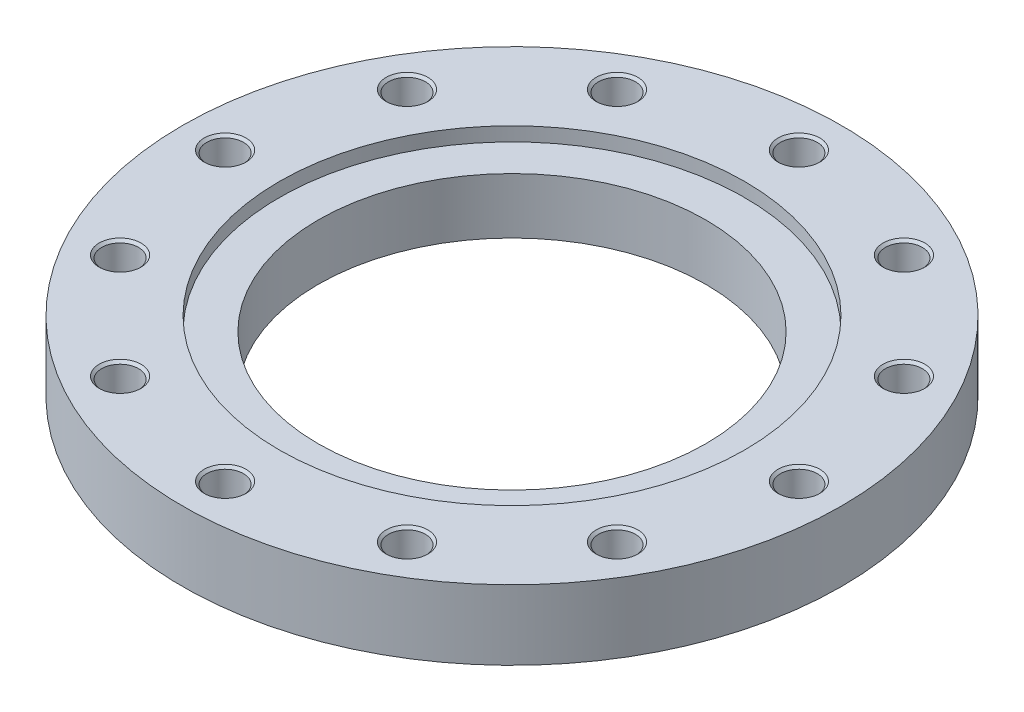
ISO-10303-21;
HEADER;
FILE_DESCRIPTION(('STEP AP214'),'2;1');
FILE_NAME('part.step','',(''),(''),'','','');
FILE_SCHEMA(('AUTOMOTIVE_DESIGN { 1 0 10303 214 1 1 1 1 }'));
ENDSEC;
DATA;
#1=APPLICATION_CONTEXT('core data for automotive mechanical design processes');
#2=APPLICATION_PROTOCOL_DEFINITION('international standard','automotive_design',2000,#1);
#3=PRODUCT_CONTEXT('',#1,'mechanical');
#4=PRODUCT('Part','Part','',(#3));
#5=PRODUCT_RELATED_PRODUCT_CATEGORY('part','',(#4));
#6=PRODUCT_DEFINITION_FORMATION('','',#4);
#7=PRODUCT_DEFINITION_CONTEXT('part definition',#1,'design');
#8=PRODUCT_DEFINITION('design','',#6,#7);
#9=PRODUCT_DEFINITION_SHAPE('','',#8);
#10=(LENGTH_UNIT() NAMED_UNIT(*) SI_UNIT(.MILLI.,.METRE.));
#11=(NAMED_UNIT(*) PLANE_ANGLE_UNIT() SI_UNIT($,.RADIAN.));
#12=(NAMED_UNIT(*) SI_UNIT($,.STERADIAN.) SOLID_ANGLE_UNIT());
#13=UNCERTAINTY_MEASURE_WITH_UNIT(LENGTH_MEASURE(1.E-05),#10,'distance_accuracy_value','');
#14=(GEOMETRIC_REPRESENTATION_CONTEXT(3) GLOBAL_UNCERTAINTY_ASSIGNED_CONTEXT((#13)) GLOBAL_UNIT_ASSIGNED_CONTEXT((#10,
#11,#12)) REPRESENTATION_CONTEXT('',''));
#15=CARTESIAN_POINT('',(0.,0.,0.));
#16=DIRECTION('',(0.,0.,1.));
#17=DIRECTION('',(1.,0.,0.));
#18=AXIS2_PLACEMENT_3D('',#15,#16,#17);
#19=CARTESIAN_POINT('',(0.,22.5,0.));
#20=DIRECTION('',(0.,-1.,0.));
#21=DIRECTION('',(1.,0.,0.));
#22=AXIS2_PLACEMENT_3D('',#19,#20,#21);
#23=CYLINDRICAL_SURFACE('',#22,212.5);
#24=CARTESIAN_POINT('',(0.,0.,0.));
#25=DIRECTION('',(0.,1.,0.));
#26=DIRECTION('',(1.,0.,0.));
#27=AXIS2_PLACEMENT_3D('',#24,#25,#26);
#28=CIRCLE('',#27,212.5);
#29=CARTESIAN_POINT('',(212.5,0.,0.));
#30=VERTEX_POINT('',#29);
#31=EDGE_CURVE('E9',#30,#30,#28,.T.);
#32=ORIENTED_EDGE('',*,*,#31,.T.);
#33=EDGE_LOOP('',(#32));
#34=FACE_BOUND('',#33,.T.);
#35=CARTESIAN_POINT('',(0.,45.,0.));
#36=DIRECTION('',(0.,1.,0.));
#37=DIRECTION('',(1.,0.,0.));
#38=AXIS2_PLACEMENT_3D('',#35,#36,#37);
#39=CIRCLE('',#38,212.5);
#40=CARTESIAN_POINT('',(212.5,45.,0.));
#41=VERTEX_POINT('',#40);
#42=EDGE_CURVE('E351',#41,#41,#39,.T.);
#43=ORIENTED_EDGE('',*,*,#42,.F.);
#44=EDGE_LOOP('',(#43));
#45=FACE_BOUND('',#44,.T.);
#46=ADVANCED_FACE('F15',(#34,#45),#23,.T.);
#47=CARTESIAN_POINT('',(168.75,0.,0.));
#48=DIRECTION('',(0.,-1.,0.));
#49=DIRECTION('',(-1.,0.,0.));
#50=AXIS2_PLACEMENT_3D('',#47,#48,#49);
#51=PLANE('',#50);
#52=CARTESIAN_POINT('',(0.,0.,0.));
#53=DIRECTION('',(0.,1.,0.));
#54=DIRECTION('',(1.,0.,0.));
#55=AXIS2_PLACEMENT_3D('',#52,#53,#54);
#56=CIRCLE('',#55,125.);
#57=CARTESIAN_POINT('',(125.,0.,0.));
#58=VERTEX_POINT('',#57);
#59=EDGE_CURVE('E22',#58,#58,#56,.T.);
#60=ORIENTED_EDGE('',*,*,#59,.T.);
#61=EDGE_LOOP('',(#60));
#62=FACE_BOUND('',#61,.T.);
#63=ORIENTED_EDGE('',*,*,#31,.F.);
#64=EDGE_LOOP('',(#63));
#65=FACE_BOUND('',#64,.T.);
#66=ADVANCED_FACE('F429',(#62,#65),#51,.T.);
#67=CARTESIAN_POINT('',(0.,22.5,0.));
#68=DIRECTION('',(0.,-1.,0.));
#69=DIRECTION('',(1.,0.,0.));
#70=AXIS2_PLACEMENT_3D('',#67,#68,#69);
#71=CYLINDRICAL_SURFACE('',#70,125.);
#72=ORIENTED_EDGE('',*,*,#59,.F.);
#73=EDGE_LOOP('',(#72));
#74=FACE_BOUND('',#73,.T.);
#75=CARTESIAN_POINT('',(0.,36.,0.));
#76=DIRECTION('',(0.,1.,0.));
#77=DIRECTION('',(1.,0.,0.));
#78=AXIS2_PLACEMENT_3D('',#75,#76,#77);
#79=CIRCLE('',#78,125.);
#80=CARTESIAN_POINT('',(-125.,36.,0.));
#81=VERTEX_POINT('',#80);
#82=EDGE_CURVE('E352',#81,#81,#79,.T.);
#83=ORIENTED_EDGE('',*,*,#82,.T.);
#84=EDGE_LOOP('',(#83));
#85=FACE_BOUND('',#84,.T.);
#86=ADVANCED_FACE('F433',(#74,#85),#71,.F.);
#87=CARTESIAN_POINT('',(168.75,45.,0.));
#88=DIRECTION('',(0.,1.,0.));
#89=DIRECTION('',(1.,0.,0.));
#90=AXIS2_PLACEMENT_3D('',#87,#88,#89);
#91=PLANE('',#90);
#92=ORIENTED_EDGE('',*,*,#42,.T.);
#93=EDGE_LOOP('',(#92));
#94=FACE_BOUND('',#93,.T.);
#95=CARTESIAN_POINT('',(0.,45.,0.));
#96=DIRECTION('',(0.,-1.,0.));
#97=DIRECTION('',(1.,0.,0.));
#98=AXIS2_PLACEMENT_3D('',#95,#96,#97);
#99=CIRCLE('',#98,150.);
#100=CARTESIAN_POINT('',(-150.,45.,0.));
#101=VERTEX_POINT('',#100);
#102=EDGE_CURVE('E349',#101,#101,#99,.T.);
#103=ORIENTED_EDGE('',*,*,#102,.T.);
#104=EDGE_LOOP('',(#103));
#105=FACE_BOUND('',#104,.T.);
#106=CARTESIAN_POINT('',(185.,45.,0.));
#107=DIRECTION('',(0.,-1.,0.));
#108=DIRECTION('',(1.,0.,0.));
#109=AXIS2_PLACEMENT_3D('',#106,#107,#108);
#110=CIRCLE('',#109,13.5);
#111=CARTESIAN_POINT('',(198.5,45.,0.));
#112=VERTEX_POINT('',#111);
#113=EDGE_CURVE('E382',#112,#112,#110,.T.);
#114=ORIENTED_EDGE('',*,*,#113,.T.);
#115=EDGE_LOOP('',(#114));
#116=FACE_BOUND('',#115,.T.);
#117=CARTESIAN_POINT('',(160.214699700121,45.,-92.5));
#118=DIRECTION('',(0.,-1.,0.));
#119=DIRECTION('',(0.866025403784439,0.,-0.5));
#120=AXIS2_PLACEMENT_3D('',#117,#118,#119);
#121=CIRCLE('',#120,13.5);
#122=CARTESIAN_POINT('',(171.906042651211,45.,-99.25));
#123=VERTEX_POINT('',#122);
#124=EDGE_CURVE('E340',#123,#123,#121,.T.);
#125=ORIENTED_EDGE('',*,*,#124,.T.);
#126=EDGE_LOOP('',(#125));
#127=FACE_BOUND('',#126,.T.);
#128=CARTESIAN_POINT('',(92.5,45.,-160.214699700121));
#129=DIRECTION('',(0.,-1.,0.));
#130=DIRECTION('',(0.5,0.,-0.866025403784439));
#131=AXIS2_PLACEMENT_3D('',#128,#129,#130);
#132=CIRCLE('',#131,13.5);
#133=CARTESIAN_POINT('',(99.25,45.,-171.906042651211));
#134=VERTEX_POINT('',#133);
#135=EDGE_CURVE('E327',#134,#134,#132,.T.);
#136=ORIENTED_EDGE('',*,*,#135,.T.);
#137=EDGE_LOOP('',(#136));
#138=FACE_BOUND('',#137,.T.);
#139=CARTESIAN_POINT('',(0.,45.,-185.));
#140=DIRECTION('',(0.,-1.,0.));
#141=DIRECTION('',(0.,0.,-1.));
#142=AXIS2_PLACEMENT_3D('',#139,#140,#141);
#143=CIRCLE('',#142,13.5);
#144=CARTESIAN_POINT('',(0.,45.,-198.5));
#145=VERTEX_POINT('',#144);
#146=EDGE_CURVE('E311',#145,#145,#143,.T.);
#147=ORIENTED_EDGE('',*,*,#146,.T.);
#148=EDGE_LOOP('',(#147));
#149=FACE_BOUND('',#148,.T.);
#150=CARTESIAN_POINT('',(-92.5,45.,-160.214699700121));
#151=DIRECTION('',(0.,-1.,0.));
#152=DIRECTION('',(-0.5,0.,-0.866025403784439));
#153=AXIS2_PLACEMENT_3D('',#150,#151,#152);
#154=CIRCLE('',#153,13.5);
#155=CARTESIAN_POINT('',(-99.25,45.,-171.906042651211));
#156=VERTEX_POINT('',#155);
#157=EDGE_CURVE('E303',#156,#156,#154,.T.);
#158=ORIENTED_EDGE('',*,*,#157,.T.);
#159=EDGE_LOOP('',(#158));
#160=FACE_BOUND('',#159,.T.);
#161=CARTESIAN_POINT('',(-160.214699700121,45.,-92.5));
#162=DIRECTION('',(0.,-1.,0.));
#163=DIRECTION('',(-0.866025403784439,0.,-0.5));
#164=AXIS2_PLACEMENT_3D('',#161,#162,#163);
#165=CIRCLE('',#164,13.5);
#166=CARTESIAN_POINT('',(-171.906042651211,45.,-99.25));
#167=VERTEX_POINT('',#166);
#168=EDGE_CURVE('E390',#167,#167,#165,.T.);
#169=ORIENTED_EDGE('',*,*,#168,.T.);
#170=EDGE_LOOP('',(#169));
#171=FACE_BOUND('',#170,.T.);
#172=CARTESIAN_POINT('',(-185.,45.,0.));
#173=DIRECTION('',(0.,-1.,0.));
#174=DIRECTION('',(-1.,0.,0.));
#175=AXIS2_PLACEMENT_3D('',#172,#173,#174);
#176=CIRCLE('',#175,13.5);
#177=CARTESIAN_POINT('',(-198.5,45.,0.));
#178=VERTEX_POINT('',#177);
#179=EDGE_CURVE('E375',#178,#178,#176,.T.);
#180=ORIENTED_EDGE('',*,*,#179,.T.);
#181=EDGE_LOOP('',(#180));
#182=FACE_BOUND('',#181,.T.);
#183=CARTESIAN_POINT('',(-160.214699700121,45.,92.5));
#184=DIRECTION('',(0.,-1.,0.));
#185=DIRECTION('',(-0.866025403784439,0.,0.5));
#186=AXIS2_PLACEMENT_3D('',#183,#184,#185);
#187=CIRCLE('',#186,13.5);
#188=CARTESIAN_POINT('',(-171.906042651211,45.,99.25));
#189=VERTEX_POINT('',#188);
#190=EDGE_CURVE('E365',#189,#189,#187,.T.);
#191=ORIENTED_EDGE('',*,*,#190,.T.);
#192=EDGE_LOOP('',(#191));
#193=FACE_BOUND('',#192,.T.);
#194=CARTESIAN_POINT('',(-92.5,45.,160.214699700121));
#195=DIRECTION('',(0.,-1.,0.));
#196=DIRECTION('',(-0.5,0.,0.866025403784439));
#197=AXIS2_PLACEMENT_3D('',#194,#195,#196);
#198=CIRCLE('',#197,13.5);
#199=CARTESIAN_POINT('',(-99.25,45.,171.906042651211));
#200=VERTEX_POINT('',#199);
#201=EDGE_CURVE('E1058',#200,#200,#198,.T.);
#202=ORIENTED_EDGE('',*,*,#201,.T.);
#203=EDGE_LOOP('',(#202));
#204=FACE_BOUND('',#203,.T.);
#205=CARTESIAN_POINT('',(0.,45.,185.));
#206=DIRECTION('',(0.,-1.,0.));
#207=DIRECTION('',(0.,0.,1.));
#208=AXIS2_PLACEMENT_3D('',#205,#206,#207);
#209=CIRCLE('',#208,13.5);
#210=CARTESIAN_POINT('',(0.,45.,198.5));
#211=VERTEX_POINT('',#210);
#212=EDGE_CURVE('E1022',#211,#211,#209,.T.);
#213=ORIENTED_EDGE('',*,*,#212,.T.);
#214=EDGE_LOOP('',(#213));
#215=FACE_BOUND('',#214,.T.);
#216=CARTESIAN_POINT('',(92.5,45.,160.214699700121));
#217=DIRECTION('',(0.,-1.,0.));
#218=DIRECTION('',(0.5,0.,0.866025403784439));
#219=AXIS2_PLACEMENT_3D('',#216,#217,#218);
#220=CIRCLE('',#219,13.5);
#221=CARTESIAN_POINT('',(99.25,45.,171.906042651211));
#222=VERTEX_POINT('',#221);
#223=EDGE_CURVE('E1030',#222,#222,#220,.T.);
#224=ORIENTED_EDGE('',*,*,#223,.T.);
#225=EDGE_LOOP('',(#224));
#226=FACE_BOUND('',#225,.T.);
#227=CARTESIAN_POINT('',(160.214699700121,45.,92.5));
#228=DIRECTION('',(0.,-1.,0.));
#229=DIRECTION('',(0.866025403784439,0.,0.5));
#230=AXIS2_PLACEMENT_3D('',#227,#228,#229);
#231=CIRCLE('',#230,13.5);
#232=CARTESIAN_POINT('',(171.906042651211,45.,99.25));
#233=VERTEX_POINT('',#232);
#234=EDGE_CURVE('E1035',#233,#233,#231,.T.);
#235=ORIENTED_EDGE('',*,*,#234,.T.);
#236=EDGE_LOOP('',(#235));
#237=FACE_BOUND('',#236,.T.);
#238=ADVANCED_FACE('F403',(#94,#105,#116,#127,#138,#149,#160,#171,#182,#193,#204,#215,#226,
#237),#91,.T.);
#239=CARTESIAN_POINT('',(0.,36.,0.));
#240=DIRECTION('',(0.,-1.,0.));
#241=DIRECTION('',(-1.,0.,0.));
#242=AXIS2_PLACEMENT_3D('',#239,#240,#241);
#243=PLANE('',#242);
#244=CARTESIAN_POINT('',(0.,36.,0.));
#245=DIRECTION('',(0.,-1.,0.));
#246=DIRECTION('',(1.,0.,0.));
#247=AXIS2_PLACEMENT_3D('',#244,#245,#246);
#248=CIRCLE('',#247,150.);
#249=CARTESIAN_POINT('',(150.,36.,0.));
#250=VERTEX_POINT('',#249);
#251=EDGE_CURVE('E350',#250,#250,#248,.T.);
#252=ORIENTED_EDGE('',*,*,#251,.F.);
#253=EDGE_LOOP('',(#252));
#254=FACE_BOUND('',#253,.T.);
#255=ORIENTED_EDGE('',*,*,#82,.F.);
#256=EDGE_LOOP('',(#255));
#257=FACE_BOUND('',#256,.T.);
#258=ADVANCED_FACE('F500',(#254,#257),#243,.F.);
#259=CARTESIAN_POINT('',(0.,42.75,0.));
#260=DIRECTION('',(0.,-1.,0.));
#261=DIRECTION('',(1.,0.,0.));
#262=AXIS2_PLACEMENT_3D('',#259,#260,#261);
#263=CYLINDRICAL_SURFACE('',#262,150.);
#264=ORIENTED_EDGE('',*,*,#251,.T.);
#265=EDGE_LOOP('',(#264));
#266=FACE_BOUND('',#265,.T.);
#267=ORIENTED_EDGE('',*,*,#102,.F.);
#268=EDGE_LOOP('',(#267));
#269=FACE_BOUND('',#268,.T.);
#270=ADVANCED_FACE('F497',(#266,#269),#263,.F.);
#271=CARTESIAN_POINT('',(185.,5.57162193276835,0.));
#272=DIRECTION('',(0.,1.,0.));
#273=DIRECTION('',(1.,0.,0.));
#274=AXIS2_PLACEMENT_3D('',#271,#272,#273);
#275=CONICAL_SURFACE('',#274,5.938125,1.0471975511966);
#276=CARTESIAN_POINT('',(185.,9.,0.));
#277=DIRECTION('',(0.,-1.,0.));
#278=DIRECTION('',(1.,0.,0.));
#279=AXIS2_PLACEMENT_3D('',#276,#277,#278);
#280=CIRCLE('',#279,11.87625);
#281=CARTESIAN_POINT('',(196.87625,9.,0.));
#282=VERTEX_POINT('',#281);
#283=EDGE_CURVE('E324',#282,#282,#280,.T.);
#284=ORIENTED_EDGE('',*,*,#283,.F.);
#285=EDGE_LOOP('',(#284));
#286=FACE_BOUND('',#285,.T.);
#287=CARTESIAN_POINT('',(185.,2.1432438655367,0.));
#288=VERTEX_POINT('',#287);
#289=VERTEX_LOOP('',#288);
#290=FACE_BOUND('',#289,.T.);
#291=ADVANCED_FACE('F446',(#286,#290),#275,.F.);
#292=CARTESIAN_POINT('',(185.,13.688125,0.));
#293=DIRECTION('',(0.,1.,0.));
#294=DIRECTION('',(1.,0.,0.));
#295=AXIS2_PLACEMENT_3D('',#292,#293,#294);
#296=CYLINDRICAL_SURFACE('',#295,11.87625);
#297=CARTESIAN_POINT('',(185.,18.37625,0.));
#298=DIRECTION('',(0.,-1.,0.));
#299=DIRECTION('',(1.,0.,0.));
#300=AXIS2_PLACEMENT_3D('',#297,#298,#299);
#301=CIRCLE('',#300,11.87625);
#302=CARTESIAN_POINT('',(196.87625,18.37625,0.));
#303=VERTEX_POINT('',#302);
#304=EDGE_CURVE('E322',#303,#303,#301,.T.);
#305=ORIENTED_EDGE('',*,*,#304,.F.);
#306=EDGE_LOOP('',(#305));
#307=FACE_BOUND('',#306,.T.);
#308=ORIENTED_EDGE('',*,*,#283,.T.);
#309=EDGE_LOOP('',(#308));
#310=FACE_BOUND('',#309,.T.);
#311=ADVANCED_FACE('F442',(#307,#310),#296,.F.);
#312=CARTESIAN_POINT('',(185.,19.188125,0.));
#313=DIRECTION('',(0.,1.,0.));
#314=DIRECTION('',(1.,0.,0.));
#315=AXIS2_PLACEMENT_3D('',#312,#313,#314);
#316=CONICAL_SURFACE('',#315,12.688125,0.785398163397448);
#317=CARTESIAN_POINT('',(185.,20.,0.));
#318=DIRECTION('',(0.,-1.,0.));
#319=DIRECTION('',(1.,0.,0.));
#320=AXIS2_PLACEMENT_3D('',#317,#318,#319);
#321=CIRCLE('',#320,13.5);
#322=CARTESIAN_POINT('',(198.5,20.,0.));
#323=VERTEX_POINT('',#322);
#324=EDGE_CURVE('E325',#323,#323,#321,.T.);
#325=ORIENTED_EDGE('',*,*,#324,.F.);
#326=EDGE_LOOP('',(#325));
#327=FACE_BOUND('',#326,.T.);
#328=ORIENTED_EDGE('',*,*,#304,.T.);
#329=EDGE_LOOP('',(#328));
#330=FACE_BOUND('',#329,.T.);
#331=ADVANCED_FACE('F445',(#327,#330),#316,.F.);
#332=CARTESIAN_POINT('',(197.688125,20.,0.));
#333=DIRECTION('',(0.,1.,0.));
#334=DIRECTION('',(-1.,0.,0.));
#335=AXIS2_PLACEMENT_3D('',#332,#333,#334);
#336=PLANE('',#335);
#337=CARTESIAN_POINT('',(185.,20.,0.));
#338=DIRECTION('',(0.,-1.,0.));
#339=DIRECTION('',(1.,0.,0.));
#340=AXIS2_PLACEMENT_3D('',#337,#338,#339);
#341=CIRCLE('',#340,11.87625);
#342=CARTESIAN_POINT('',(196.87625,20.,0.));
#343=VERTEX_POINT('',#342);
#344=EDGE_CURVE('E347',#343,#343,#341,.T.);
#345=ORIENTED_EDGE('',*,*,#344,.F.);
#346=EDGE_LOOP('',(#345));
#347=FACE_BOUND('',#346,.T.);
#348=ORIENTED_EDGE('',*,*,#324,.T.);
#349=EDGE_LOOP('',(#348));
#350=FACE_BOUND('',#349,.T.);
#351=ADVANCED_FACE('F452',(#347,#350),#336,.F.);
#352=CARTESIAN_POINT('',(185.,31.688125,0.));
#353=DIRECTION('',(0.,1.,0.));
#354=DIRECTION('',(1.,0.,0.));
#355=AXIS2_PLACEMENT_3D('',#352,#353,#354);
#356=CYLINDRICAL_SURFACE('',#355,11.87625);
#357=CARTESIAN_POINT('',(185.,43.37625,0.));
#358=DIRECTION('',(0.,-1.,0.));
#359=DIRECTION('',(1.,0.,0.));
#360=AXIS2_PLACEMENT_3D('',#357,#358,#359);
#361=CIRCLE('',#360,11.87625);
#362=CARTESIAN_POINT('',(196.87625,43.37625,0.));
#363=VERTEX_POINT('',#362);
#364=EDGE_CURVE('E345',#363,#363,#361,.T.);
#365=ORIENTED_EDGE('',*,*,#364,.F.);
#366=EDGE_LOOP('',(#365));
#367=FACE_BOUND('',#366,.T.);
#368=ORIENTED_EDGE('',*,*,#344,.T.);
#369=EDGE_LOOP('',(#368));
#370=FACE_BOUND('',#369,.T.);
#371=ADVANCED_FACE('F448',(#367,#370),#356,.F.);
#372=CARTESIAN_POINT('',(185.,44.188125,0.));
#373=DIRECTION('',(0.,1.,0.));
#374=DIRECTION('',(1.,0.,0.));
#375=AXIS2_PLACEMENT_3D('',#372,#373,#374);
#376=CONICAL_SURFACE('',#375,12.688125,0.785398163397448);
#377=ORIENTED_EDGE('',*,*,#113,.F.);
#378=EDGE_LOOP('',(#377));
#379=FACE_BOUND('',#378,.T.);
#380=ORIENTED_EDGE('',*,*,#364,.T.);
#381=EDGE_LOOP('',(#380));
#382=FACE_BOUND('',#381,.T.);
#383=ADVANCED_FACE('F451',(#379,#382),#376,.F.);
#384=CARTESIAN_POINT('',(160.214699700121,5.57162193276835,-92.5));
#385=DIRECTION('',(0.,1.,0.));
#386=DIRECTION('',(0.866025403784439,0.,-0.5));
#387=AXIS2_PLACEMENT_3D('',#384,#385,#386);
#388=CONICAL_SURFACE('',#387,5.938125,1.0471975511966);
#389=CARTESIAN_POINT('',(160.214699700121,9.,-92.5));
#390=DIRECTION('',(0.,-1.,0.));
#391=DIRECTION('',(0.866025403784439,0.,-0.5));
#392=AXIS2_PLACEMENT_3D('',#389,#390,#391);
#393=CIRCLE('',#392,11.87625);
#394=CARTESIAN_POINT('',(170.499833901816,9.,-98.438125));
#395=VERTEX_POINT('',#394);
#396=EDGE_CURVE('E343',#395,#395,#393,.T.);
#397=ORIENTED_EDGE('',*,*,#396,.F.);
#398=EDGE_LOOP('',(#397));
#399=FACE_BOUND('',#398,.T.);
#400=CARTESIAN_POINT('',(160.214699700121,2.1432438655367,-92.5));
#401=VERTEX_POINT('',#400);
#402=VERTEX_LOOP('',#401);
#403=FACE_BOUND('',#402,.T.);
#404=ADVANCED_FACE('F454',(#399,#403),#388,.F.);
#405=CARTESIAN_POINT('',(160.214699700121,13.688125,-92.5));
#406=DIRECTION('',(0.,1.,0.));
#407=DIRECTION('',(0.866025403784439,0.,-0.5));
#408=AXIS2_PLACEMENT_3D('',#405,#406,#407);
#409=CYLINDRICAL_SURFACE('',#408,11.87625);
#410=CARTESIAN_POINT('',(160.214699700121,18.37625,-92.5));
#411=DIRECTION('',(0.,-1.,0.));
#412=DIRECTION('',(0.866025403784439,0.,-0.5));
#413=AXIS2_PLACEMENT_3D('',#410,#411,#412);
#414=CIRCLE('',#413,11.87625);
#415=CARTESIAN_POINT('',(170.499833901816,18.37625,-98.438125));
#416=VERTEX_POINT('',#415);
#417=EDGE_CURVE('E341',#416,#416,#414,.T.);
#418=ORIENTED_EDGE('',*,*,#417,.F.);
#419=EDGE_LOOP('',(#418));
#420=FACE_BOUND('',#419,.T.);
#421=ORIENTED_EDGE('',*,*,#396,.T.);
#422=EDGE_LOOP('',(#421));
#423=FACE_BOUND('',#422,.T.);
#424=ADVANCED_FACE('F457',(#420,#423),#409,.F.);
#425=CARTESIAN_POINT('',(160.214699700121,19.188125,-92.5));
#426=DIRECTION('',(0.,1.,0.));
#427=DIRECTION('',(0.866025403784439,0.,-0.5));
#428=AXIS2_PLACEMENT_3D('',#425,#426,#427);
#429=CONICAL_SURFACE('',#428,12.688125,0.785398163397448);
#430=CARTESIAN_POINT('',(160.214699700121,20.,-92.5));
#431=DIRECTION('',(0.,-1.,0.));
#432=DIRECTION('',(0.866025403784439,0.,-0.5));
#433=AXIS2_PLACEMENT_3D('',#430,#431,#432);
#434=CIRCLE('',#433,13.5);
#435=CARTESIAN_POINT('',(171.906042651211,20.,-99.25));
#436=VERTEX_POINT('',#435);
#437=EDGE_CURVE('E339',#436,#436,#434,.T.);
#438=ORIENTED_EDGE('',*,*,#437,.F.);
#439=EDGE_LOOP('',(#438));
#440=FACE_BOUND('',#439,.T.);
#441=ORIENTED_EDGE('',*,*,#417,.T.);
#442=EDGE_LOOP('',(#441));
#443=FACE_BOUND('',#442,.T.);
#444=ADVANCED_FACE('F997',(#440,#443),#429,.F.);
#445=CARTESIAN_POINT('',(171.202938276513,20.,-98.8440625));
#446=DIRECTION('',(0.,1.,0.));
#447=DIRECTION('',(-0.866025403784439,0.,0.5));
#448=AXIS2_PLACEMENT_3D('',#445,#446,#447);
#449=PLANE('',#448);
#450=CARTESIAN_POINT('',(160.214699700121,20.,-92.5));
#451=DIRECTION('',(0.,-1.,0.));
#452=DIRECTION('',(0.866025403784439,0.,-0.5));
#453=AXIS2_PLACEMENT_3D('',#450,#451,#452);
#454=CIRCLE('',#453,11.87625);
#455=CARTESIAN_POINT('',(170.499833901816,20.,-98.438125));
#456=VERTEX_POINT('',#455);
#457=EDGE_CURVE('E337',#456,#456,#454,.T.);
#458=ORIENTED_EDGE('',*,*,#457,.F.);
#459=EDGE_LOOP('',(#458));
#460=FACE_BOUND('',#459,.T.);
#461=ORIENTED_EDGE('',*,*,#437,.T.);
#462=EDGE_LOOP('',(#461));
#463=FACE_BOUND('',#462,.T.);
#464=ADVANCED_FACE('F463',(#460,#463),#449,.F.);
#465=CARTESIAN_POINT('',(160.214699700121,31.688125,-92.5));
#466=DIRECTION('',(0.,1.,0.));
#467=DIRECTION('',(0.866025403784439,0.,-0.5));
#468=AXIS2_PLACEMENT_3D('',#465,#466,#467);
#469=CYLINDRICAL_SURFACE('',#468,11.87625);
#470=CARTESIAN_POINT('',(160.214699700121,43.37625,-92.5));
#471=DIRECTION('',(0.,-1.,0.));
#472=DIRECTION('',(0.866025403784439,0.,-0.5));
#473=AXIS2_PLACEMENT_3D('',#470,#471,#472);
#474=CIRCLE('',#473,11.87625);
#475=CARTESIAN_POINT('',(170.499833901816,43.37625,-98.438125));
#476=VERTEX_POINT('',#475);
#477=EDGE_CURVE('E306',#476,#476,#474,.T.);
#478=ORIENTED_EDGE('',*,*,#477,.F.);
#479=EDGE_LOOP('',(#478));
#480=FACE_BOUND('',#479,.T.);
#481=ORIENTED_EDGE('',*,*,#457,.T.);
#482=EDGE_LOOP('',(#481));
#483=FACE_BOUND('',#482,.T.);
#484=ADVANCED_FACE('F459',(#480,#483),#469,.F.);
#485=CARTESIAN_POINT('',(160.214699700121,44.188125,-92.5));
#486=DIRECTION('',(0.,1.,0.));
#487=DIRECTION('',(0.866025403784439,0.,-0.5));
#488=AXIS2_PLACEMENT_3D('',#485,#486,#487);
#489=CONICAL_SURFACE('',#488,12.688125,0.785398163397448);
#490=ORIENTED_EDGE('',*,*,#124,.F.);
#491=EDGE_LOOP('',(#490));
#492=FACE_BOUND('',#491,.T.);
#493=ORIENTED_EDGE('',*,*,#477,.T.);
#494=EDGE_LOOP('',(#493));
#495=FACE_BOUND('',#494,.T.);
#496=ADVANCED_FACE('F462',(#492,#495),#489,.F.);
#497=CARTESIAN_POINT('',(92.5,5.57162193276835,-160.214699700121));
#498=DIRECTION('',(0.,1.,0.));
#499=DIRECTION('',(0.5,0.,-0.866025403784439));
#500=AXIS2_PLACEMENT_3D('',#497,#498,#499);
#501=CONICAL_SURFACE('',#500,5.938125,1.0471975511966);
#502=CARTESIAN_POINT('',(92.5,9.,-160.214699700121));
#503=DIRECTION('',(0.,-1.,0.));
#504=DIRECTION('',(0.5,0.,-0.866025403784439));
#505=AXIS2_PLACEMENT_3D('',#502,#503,#504);
#506=CIRCLE('',#505,11.87625);
#507=CARTESIAN_POINT('',(98.438125,9.,-170.499833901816));
#508=VERTEX_POINT('',#507);
#509=EDGE_CURVE('E335',#508,#508,#506,.T.);
#510=ORIENTED_EDGE('',*,*,#509,.F.);
#511=EDGE_LOOP('',(#510));
#512=FACE_BOUND('',#511,.T.);
#513=CARTESIAN_POINT('',(92.5,2.1432438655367,-160.214699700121));
#514=VERTEX_POINT('',#513);
#515=VERTEX_LOOP('',#514);
#516=FACE_BOUND('',#515,.T.);
#517=ADVANCED_FACE('F467',(#512,#516),#501,.F.);
#518=CARTESIAN_POINT('',(92.5,13.688125,-160.214699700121));
#519=DIRECTION('',(0.,1.,0.));
#520=DIRECTION('',(0.5,0.,-0.866025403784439));
#521=AXIS2_PLACEMENT_3D('',#518,#519,#520);
#522=CYLINDRICAL_SURFACE('',#521,11.87625);
#523=CARTESIAN_POINT('',(92.5,18.37625,-160.214699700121));
#524=DIRECTION('',(0.,-1.,0.));
#525=DIRECTION('',(0.5,0.,-0.866025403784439));
#526=AXIS2_PLACEMENT_3D('',#523,#524,#525);
#527=CIRCLE('',#526,11.87625);
#528=CARTESIAN_POINT('',(98.438125,18.37625,-170.499833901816));
#529=VERTEX_POINT('',#528);
#530=EDGE_CURVE('E333',#529,#529,#527,.T.);
#531=ORIENTED_EDGE('',*,*,#530,.F.);
#532=EDGE_LOOP('',(#531));
#533=FACE_BOUND('',#532,.T.);
#534=ORIENTED_EDGE('',*,*,#509,.T.);
#535=EDGE_LOOP('',(#534));
#536=FACE_BOUND('',#535,.T.);
#537=ADVANCED_FACE('F471',(#533,#536),#522,.F.);
#538=CARTESIAN_POINT('',(92.5,19.188125,-160.214699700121));
#539=DIRECTION('',(0.,1.,0.));
#540=DIRECTION('',(0.5,0.,-0.866025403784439));
#541=AXIS2_PLACEMENT_3D('',#538,#539,#540);
#542=CONICAL_SURFACE('',#541,12.688125,0.785398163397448);
#543=CARTESIAN_POINT('',(92.5,20.,-160.214699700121));
#544=DIRECTION('',(0.,-1.,0.));
#545=DIRECTION('',(0.5,0.,-0.866025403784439));
#546=AXIS2_PLACEMENT_3D('',#543,#544,#545);
#547=CIRCLE('',#546,13.5);
#548=CARTESIAN_POINT('',(99.25,20.,-171.906042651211));
#549=VERTEX_POINT('',#548);
#550=EDGE_CURVE('E331',#549,#549,#547,.T.);
#551=ORIENTED_EDGE('',*,*,#550,.F.);
#552=EDGE_LOOP('',(#551));
#553=FACE_BOUND('',#552,.T.);
#554=ORIENTED_EDGE('',*,*,#530,.T.);
#555=EDGE_LOOP('',(#554));
#556=FACE_BOUND('',#555,.T.);
#557=ADVANCED_FACE('F475',(#553,#556),#542,.F.);
#558=CARTESIAN_POINT('',(98.8440625,20.,-171.202938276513));
#559=DIRECTION('',(0.,1.,0.));
#560=DIRECTION('',(-0.5,0.,0.866025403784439));
#561=AXIS2_PLACEMENT_3D('',#558,#559,#560);
#562=PLANE('',#561);
#563=CARTESIAN_POINT('',(92.5,20.,-160.214699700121));
#564=DIRECTION('',(0.,-1.,0.));
#565=DIRECTION('',(0.5,0.,-0.866025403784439));
#566=AXIS2_PLACEMENT_3D('',#563,#564,#565);
#567=CIRCLE('',#566,11.87625);
#568=CARTESIAN_POINT('',(98.438125,20.,-170.499833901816));
#569=VERTEX_POINT('',#568);
#570=EDGE_CURVE('E329',#569,#569,#567,.T.);
#571=ORIENTED_EDGE('',*,*,#570,.F.);
#572=EDGE_LOOP('',(#571));
#573=FACE_BOUND('',#572,.T.);
#574=ORIENTED_EDGE('',*,*,#550,.T.);
#575=EDGE_LOOP('',(#574));
#576=FACE_BOUND('',#575,.T.);
#577=ADVANCED_FACE('F479',(#573,#576),#562,.F.);
#578=CARTESIAN_POINT('',(92.5,31.688125,-160.214699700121));
#579=DIRECTION('',(0.,1.,0.));
#580=DIRECTION('',(0.5,0.,-0.866025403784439));
#581=AXIS2_PLACEMENT_3D('',#578,#579,#580);
#582=CYLINDRICAL_SURFACE('',#581,11.87625);
#583=CARTESIAN_POINT('',(92.5,43.37625,-160.214699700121));
#584=DIRECTION('',(0.,-1.,0.));
#585=DIRECTION('',(0.5,0.,-0.866025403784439));
#586=AXIS2_PLACEMENT_3D('',#583,#584,#585);
#587=CIRCLE('',#586,11.87625);
#588=CARTESIAN_POINT('',(98.438125,43.37625,-170.499833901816));
#589=VERTEX_POINT('',#588);
#590=EDGE_CURVE('E321',#589,#589,#587,.T.);
#591=ORIENTED_EDGE('',*,*,#590,.F.);
#592=EDGE_LOOP('',(#591));
#593=FACE_BOUND('',#592,.T.);
#594=ORIENTED_EDGE('',*,*,#570,.T.);
#595=EDGE_LOOP('',(#594));
#596=FACE_BOUND('',#595,.T.);
#597=ADVANCED_FACE('F483',(#593,#596),#582,.F.);
#598=CARTESIAN_POINT('',(92.5,44.188125,-160.214699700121));
#599=DIRECTION('',(0.,1.,0.));
#600=DIRECTION('',(0.5,0.,-0.866025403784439));
#601=AXIS2_PLACEMENT_3D('',#598,#599,#600);
#602=CONICAL_SURFACE('',#601,12.688125,0.785398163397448);
#603=ORIENTED_EDGE('',*,*,#135,.F.);
#604=EDGE_LOOP('',(#603));
#605=FACE_BOUND('',#604,.T.);
#606=ORIENTED_EDGE('',*,*,#590,.T.);
#607=EDGE_LOOP('',(#606));
#608=FACE_BOUND('',#607,.T.);
#609=ADVANCED_FACE('F487',(#605,#608),#602,.F.);
#610=CARTESIAN_POINT('',(0.,5.57162193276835,-185.));
#611=DIRECTION('',(0.,1.,0.));
#612=DIRECTION('',(0.,0.,-1.));
#613=AXIS2_PLACEMENT_3D('',#610,#611,#612);
#614=CONICAL_SURFACE('',#613,5.938125,1.0471975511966);
#615=CARTESIAN_POINT('',(0.,9.,-185.));
#616=DIRECTION('',(0.,-1.,0.));
#617=DIRECTION('',(0.,0.,-1.));
#618=AXIS2_PLACEMENT_3D('',#615,#616,#617);
#619=CIRCLE('',#618,11.87625);
#620=CARTESIAN_POINT('',(0.,9.,-196.87625));
#621=VERTEX_POINT('',#620);
#622=EDGE_CURVE('E319',#621,#621,#619,.T.);
#623=ORIENTED_EDGE('',*,*,#622,.F.);
#624=EDGE_LOOP('',(#623));
#625=FACE_BOUND('',#624,.T.);
#626=CARTESIAN_POINT('',(0.,2.1432438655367,-185.));
#627=VERTEX_POINT('',#626);
#628=VERTEX_LOOP('',#627);
#629=FACE_BOUND('',#628,.T.);
#630=ADVANCED_FACE('F491',(#625,#629),#614,.F.);
#631=CARTESIAN_POINT('',(0.,13.688125,-185.));
#632=DIRECTION('',(0.,1.,0.));
#633=DIRECTION('',(0.,0.,-1.));
#634=AXIS2_PLACEMENT_3D('',#631,#632,#633);
#635=CYLINDRICAL_SURFACE('',#634,11.87625);
#636=CARTESIAN_POINT('',(0.,18.37625,-185.));
#637=DIRECTION('',(0.,-1.,0.));
#638=DIRECTION('',(0.,0.,-1.));
#639=AXIS2_PLACEMENT_3D('',#636,#637,#638);
#640=CIRCLE('',#639,11.87625);
#641=CARTESIAN_POINT('',(0.,18.37625,-196.87625));
#642=VERTEX_POINT('',#641);
#643=EDGE_CURVE('E317',#642,#642,#640,.T.);
#644=ORIENTED_EDGE('',*,*,#643,.F.);
#645=EDGE_LOOP('',(#644));
#646=FACE_BOUND('',#645,.T.);
#647=ORIENTED_EDGE('',*,*,#622,.T.);
#648=EDGE_LOOP('',(#647));
#649=FACE_BOUND('',#648,.T.);
#650=ADVANCED_FACE('F495',(#646,#649),#635,.F.);
#651=CARTESIAN_POINT('',(0.,19.188125,-185.));
#652=DIRECTION('',(0.,1.,0.));
#653=DIRECTION('',(0.,0.,-1.));
#654=AXIS2_PLACEMENT_3D('',#651,#652,#653);
#655=CONICAL_SURFACE('',#654,12.688125,0.785398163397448);
#656=CARTESIAN_POINT('',(0.,20.,-185.));
#657=DIRECTION('',(0.,-1.,0.));
#658=DIRECTION('',(0.,0.,-1.));
#659=AXIS2_PLACEMENT_3D('',#656,#657,#658);
#660=CIRCLE('',#659,13.5);
#661=CARTESIAN_POINT('',(0.,20.,-198.5));
#662=VERTEX_POINT('',#661);
#663=EDGE_CURVE('E315',#662,#662,#660,.T.);
#664=ORIENTED_EDGE('',*,*,#663,.F.);
#665=EDGE_LOOP('',(#664));
#666=FACE_BOUND('',#665,.T.);
#667=ORIENTED_EDGE('',*,*,#643,.T.);
#668=EDGE_LOOP('',(#667));
#669=FACE_BOUND('',#668,.T.);
#670=ADVANCED_FACE('F504',(#666,#669),#655,.F.);
#671=CARTESIAN_POINT('',(0.,20.,-197.688125));
#672=DIRECTION('',(0.,1.,0.));
#673=DIRECTION('',(0.,0.,1.));
#674=AXIS2_PLACEMENT_3D('',#671,#672,#673);
#675=PLANE('',#674);
#676=CARTESIAN_POINT('',(0.,20.,-185.));
#677=DIRECTION('',(0.,-1.,0.));
#678=DIRECTION('',(0.,0.,-1.));
#679=AXIS2_PLACEMENT_3D('',#676,#677,#678);
#680=CIRCLE('',#679,11.87625);
#681=CARTESIAN_POINT('',(0.,20.,-196.87625));
#682=VERTEX_POINT('',#681);
#683=EDGE_CURVE('E313',#682,#682,#680,.T.);
#684=ORIENTED_EDGE('',*,*,#683,.F.);
#685=EDGE_LOOP('',(#684));
#686=FACE_BOUND('',#685,.T.);
#687=ORIENTED_EDGE('',*,*,#663,.T.);
#688=EDGE_LOOP('',(#687));
#689=FACE_BOUND('',#688,.T.);
#690=ADVANCED_FACE('F508',(#686,#689),#675,.F.);
#691=CARTESIAN_POINT('',(0.,31.688125,-185.));
#692=DIRECTION('',(0.,1.,0.));
#693=DIRECTION('',(0.,0.,-1.));
#694=AXIS2_PLACEMENT_3D('',#691,#692,#693);
#695=CYLINDRICAL_SURFACE('',#694,11.87625);
#696=CARTESIAN_POINT('',(0.,43.37625,-185.));
#697=DIRECTION('',(0.,-1.,0.));
#698=DIRECTION('',(0.,0.,-1.));
#699=AXIS2_PLACEMENT_3D('',#696,#697,#698);
#700=CIRCLE('',#699,11.87625);
#701=CARTESIAN_POINT('',(0.,43.37625,-196.87625));
#702=VERTEX_POINT('',#701);
#703=EDGE_CURVE('E309',#702,#702,#700,.T.);
#704=ORIENTED_EDGE('',*,*,#703,.F.);
#705=EDGE_LOOP('',(#704));
#706=FACE_BOUND('',#705,.T.);
#707=ORIENTED_EDGE('',*,*,#683,.T.);
#708=EDGE_LOOP('',(#707));
#709=FACE_BOUND('',#708,.T.);
#710=ADVANCED_FACE('F512',(#706,#709),#695,.F.);
#711=CARTESIAN_POINT('',(0.,44.188125,-185.));
#712=DIRECTION('',(0.,1.,0.));
#713=DIRECTION('',(0.,0.,-1.));
#714=AXIS2_PLACEMENT_3D('',#711,#712,#713);
#715=CONICAL_SURFACE('',#714,12.688125,0.785398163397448);
#716=ORIENTED_EDGE('',*,*,#146,.F.);
#717=EDGE_LOOP('',(#716));
#718=FACE_BOUND('',#717,.T.);
#719=ORIENTED_EDGE('',*,*,#703,.T.);
#720=EDGE_LOOP('',(#719));
#721=FACE_BOUND('',#720,.T.);
#722=ADVANCED_FACE('F519',(#718,#721),#715,.F.);
#723=CARTESIAN_POINT('',(-92.5,5.57162193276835,-160.214699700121));
#724=DIRECTION('',(0.,1.,0.));
#725=DIRECTION('',(-0.5,0.,-0.866025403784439));
#726=AXIS2_PLACEMENT_3D('',#723,#724,#725);
#727=CONICAL_SURFACE('',#726,5.938125,1.0471975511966);
#728=CARTESIAN_POINT('',(-92.5,9.,-160.214699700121));
#729=DIRECTION('',(0.,-1.,0.));
#730=DIRECTION('',(-0.5,0.,-0.866025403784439));
#731=AXIS2_PLACEMENT_3D('',#728,#729,#730);
#732=CIRCLE('',#731,11.87625);
#733=CARTESIAN_POINT('',(-98.438125,9.,-170.499833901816));
#734=VERTEX_POINT('',#733);
#735=EDGE_CURVE('E301',#734,#734,#732,.T.);
#736=ORIENTED_EDGE('',*,*,#735,.F.);
#737=EDGE_LOOP('',(#736));
#738=FACE_BOUND('',#737,.T.);
#739=CARTESIAN_POINT('',(-92.5,2.1432438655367,-160.214699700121));
#740=VERTEX_POINT('',#739);
#741=VERTEX_LOOP('',#740);
#742=FACE_BOUND('',#741,.T.);
#743=ADVANCED_FACE('F523',(#738,#742),#727,.F.);
#744=CARTESIAN_POINT('',(-92.5,13.688125,-160.214699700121));
#745=DIRECTION('',(0.,1.,0.));
#746=DIRECTION('',(-0.5,0.,-0.866025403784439));
#747=AXIS2_PLACEMENT_3D('',#744,#745,#746);
#748=CYLINDRICAL_SURFACE('',#747,11.87625);
#749=CARTESIAN_POINT('',(-92.5,18.37625,-160.214699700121));
#750=DIRECTION('',(0.,-1.,0.));
#751=DIRECTION('',(-0.5,0.,-0.866025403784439));
#752=AXIS2_PLACEMENT_3D('',#749,#750,#751);
#753=CIRCLE('',#752,11.87625);
#754=CARTESIAN_POINT('',(-98.438125,18.37625,-170.499833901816));
#755=VERTEX_POINT('',#754);
#756=EDGE_CURVE('E298',#755,#755,#753,.T.);
#757=ORIENTED_EDGE('',*,*,#756,.F.);
#758=EDGE_LOOP('',(#757));
#759=FACE_BOUND('',#758,.T.);
#760=ORIENTED_EDGE('',*,*,#735,.T.);
#761=EDGE_LOOP('',(#760));
#762=FACE_BOUND('',#761,.T.);
#763=ADVANCED_FACE('F426',(#759,#762),#748,.F.);
#764=CARTESIAN_POINT('',(-92.5,19.188125,-160.214699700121));
#765=DIRECTION('',(0.,1.,0.));
#766=DIRECTION('',(-0.5,0.,-0.866025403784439));
#767=AXIS2_PLACEMENT_3D('',#764,#765,#766);
#768=CONICAL_SURFACE('',#767,12.688125,0.785398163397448);
#769=CARTESIAN_POINT('',(-92.5,20.,-160.214699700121));
#770=DIRECTION('',(0.,-1.,0.));
#771=DIRECTION('',(-0.5,0.,-0.866025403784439));
#772=AXIS2_PLACEMENT_3D('',#769,#770,#771);
#773=CIRCLE('',#772,13.5);
#774=CARTESIAN_POINT('',(-99.25,20.,-171.906042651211));
#775=VERTEX_POINT('',#774);
#776=EDGE_CURVE('E295',#775,#775,#773,.T.);
#777=ORIENTED_EDGE('',*,*,#776,.F.);
#778=EDGE_LOOP('',(#777));
#779=FACE_BOUND('',#778,.T.);
#780=ORIENTED_EDGE('',*,*,#756,.T.);
#781=EDGE_LOOP('',(#780));
#782=FACE_BOUND('',#781,.T.);
#783=ADVANCED_FACE('F420',(#779,#782),#768,.F.);
#784=CARTESIAN_POINT('',(-98.8440625,20.,-171.202938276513));
#785=DIRECTION('',(0.,1.,0.));
#786=DIRECTION('',(0.5,0.,0.866025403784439));
#787=AXIS2_PLACEMENT_3D('',#784,#785,#786);
#788=PLANE('',#787);
#789=CARTESIAN_POINT('',(-92.5,20.,-160.214699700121));
#790=DIRECTION('',(0.,-1.,0.));
#791=DIRECTION('',(-0.5,0.,-0.866025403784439));
#792=AXIS2_PLACEMENT_3D('',#789,#790,#791);
#793=CIRCLE('',#792,11.87625);
#794=CARTESIAN_POINT('',(-98.438125,20.,-170.499833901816));
#795=VERTEX_POINT('',#794);
#796=EDGE_CURVE('E299',#795,#795,#793,.T.);
#797=ORIENTED_EDGE('',*,*,#796,.F.);
#798=EDGE_LOOP('',(#797));
#799=FACE_BOUND('',#798,.T.);
#800=ORIENTED_EDGE('',*,*,#776,.T.);
#801=EDGE_LOOP('',(#800));
#802=FACE_BOUND('',#801,.T.);
#803=ADVANCED_FACE('F296',(#799,#802),#788,.F.);
#804=CARTESIAN_POINT('',(-92.5,31.688125,-160.214699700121));
#805=DIRECTION('',(0.,1.,0.));
#806=DIRECTION('',(-0.5,0.,-0.866025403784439));
#807=AXIS2_PLACEMENT_3D('',#804,#805,#806);
#808=CYLINDRICAL_SURFACE('',#807,11.87625);
#809=CARTESIAN_POINT('',(-92.5,43.37625,-160.214699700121));
#810=DIRECTION('',(0.,-1.,0.));
#811=DIRECTION('',(-0.5,0.,-0.866025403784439));
#812=AXIS2_PLACEMENT_3D('',#809,#810,#811);
#813=CIRCLE('',#812,11.87625);
#814=CARTESIAN_POINT('',(-98.438125,43.37625,-170.499833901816));
#815=VERTEX_POINT('',#814);
#816=EDGE_CURVE('E399',#815,#815,#813,.T.);
#817=ORIENTED_EDGE('',*,*,#816,.F.);
#818=EDGE_LOOP('',(#817));
#819=FACE_BOUND('',#818,.T.);
#820=ORIENTED_EDGE('',*,*,#796,.T.);
#821=EDGE_LOOP('',(#820));
#822=FACE_BOUND('',#821,.T.);
#823=ADVANCED_FACE('F410',(#819,#822),#808,.F.);
#824=CARTESIAN_POINT('',(-92.5,44.188125,-160.214699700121));
#825=DIRECTION('',(0.,1.,0.));
#826=DIRECTION('',(-0.5,0.,-0.866025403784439));
#827=AXIS2_PLACEMENT_3D('',#824,#825,#826);
#828=CONICAL_SURFACE('',#827,12.688125,0.785398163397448);
#829=ORIENTED_EDGE('',*,*,#157,.F.);
#830=EDGE_LOOP('',(#829));
#831=FACE_BOUND('',#830,.T.);
#832=ORIENTED_EDGE('',*,*,#816,.T.);
#833=EDGE_LOOP('',(#832));
#834=FACE_BOUND('',#833,.T.);
#835=ADVANCED_FACE('F406',(#831,#834),#828,.F.);
#836=CARTESIAN_POINT('',(-160.214699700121,5.57162193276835,-92.5));
#837=DIRECTION('',(0.,1.,0.));
#838=DIRECTION('',(-0.866025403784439,0.,-0.5));
#839=AXIS2_PLACEMENT_3D('',#836,#837,#838);
#840=CONICAL_SURFACE('',#839,5.938125,1.0471975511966);
#841=CARTESIAN_POINT('',(-160.214699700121,9.,-92.5));
#842=DIRECTION('',(0.,-1.,0.));
#843=DIRECTION('',(-0.866025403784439,0.,-0.5));
#844=AXIS2_PLACEMENT_3D('',#841,#842,#843);
#845=CIRCLE('',#844,11.87625);
#846=CARTESIAN_POINT('',(-170.499833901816,9.,-98.438125));
#847=VERTEX_POINT('',#846);
#848=EDGE_CURVE('E397',#847,#847,#845,.T.);
#849=ORIENTED_EDGE('',*,*,#848,.F.);
#850=EDGE_LOOP('',(#849));
#851=FACE_BOUND('',#850,.T.);
#852=CARTESIAN_POINT('',(-160.214699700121,2.1432438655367,-92.5));
#853=VERTEX_POINT('',#852);
#854=VERTEX_LOOP('',#853);
#855=FACE_BOUND('',#854,.T.);
#856=ADVANCED_FACE('F409',(#851,#855),#840,.F.);
#857=CARTESIAN_POINT('',(-160.214699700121,13.688125,-92.5));
#858=DIRECTION('',(0.,1.,0.));
#859=DIRECTION('',(-0.866025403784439,0.,-0.5));
#860=AXIS2_PLACEMENT_3D('',#857,#858,#859);
#861=CYLINDRICAL_SURFACE('',#860,11.87625);
#862=CARTESIAN_POINT('',(-160.214699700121,18.37625,-92.5));
#863=DIRECTION('',(0.,-1.,0.));
#864=DIRECTION('',(-0.866025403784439,0.,-0.5));
#865=AXIS2_PLACEMENT_3D('',#862,#863,#864);
#866=CIRCLE('',#865,11.87625);
#867=CARTESIAN_POINT('',(-170.499833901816,18.37625,-98.438125));
#868=VERTEX_POINT('',#867);
#869=EDGE_CURVE('E395',#868,#868,#866,.T.);
#870=ORIENTED_EDGE('',*,*,#869,.F.);
#871=EDGE_LOOP('',(#870));
#872=FACE_BOUND('',#871,.T.);
#873=ORIENTED_EDGE('',*,*,#848,.T.);
#874=EDGE_LOOP('',(#873));
#875=FACE_BOUND('',#874,.T.);
#876=ADVANCED_FACE('F573',(#872,#875),#861,.F.);
#877=CARTESIAN_POINT('',(-160.214699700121,19.188125,-92.5));
#878=DIRECTION('',(0.,1.,0.));
#879=DIRECTION('',(-0.866025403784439,0.,-0.5));
#880=AXIS2_PLACEMENT_3D('',#877,#878,#879);
#881=CONICAL_SURFACE('',#880,12.688125,0.785398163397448);
#882=CARTESIAN_POINT('',(-160.214699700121,20.,-92.5));
#883=DIRECTION('',(0.,-1.,0.));
#884=DIRECTION('',(-0.866025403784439,0.,-0.5));
#885=AXIS2_PLACEMENT_3D('',#882,#883,#884);
#886=CIRCLE('',#885,13.5);
#887=CARTESIAN_POINT('',(-171.906042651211,20.,-99.25));
#888=VERTEX_POINT('',#887);
#889=EDGE_CURVE('E393',#888,#888,#886,.T.);
#890=ORIENTED_EDGE('',*,*,#889,.F.);
#891=EDGE_LOOP('',(#890));
#892=FACE_BOUND('',#891,.T.);
#893=ORIENTED_EDGE('',*,*,#869,.T.);
#894=EDGE_LOOP('',(#893));
#895=FACE_BOUND('',#894,.T.);
#896=ADVANCED_FACE('F583',(#892,#895),#881,.F.);
#897=CARTESIAN_POINT('',(-171.202938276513,20.,-98.8440625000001));
#898=DIRECTION('',(0.,1.,0.));
#899=DIRECTION('',(0.866025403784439,0.,0.5));
#900=AXIS2_PLACEMENT_3D('',#897,#898,#899);
#901=PLANE('',#900);
#902=CARTESIAN_POINT('',(-160.214699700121,20.,-92.5));
#903=DIRECTION('',(0.,-1.,0.));
#904=DIRECTION('',(-0.866025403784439,0.,-0.5));
#905=AXIS2_PLACEMENT_3D('',#902,#903,#904);
#906=CIRCLE('',#905,11.87625);
#907=CARTESIAN_POINT('',(-170.499833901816,20.,-98.438125));
#908=VERTEX_POINT('',#907);
#909=EDGE_CURVE('E391',#908,#908,#906,.T.);
#910=ORIENTED_EDGE('',*,*,#909,.F.);
#911=EDGE_LOOP('',(#910));
#912=FACE_BOUND('',#911,.T.);
#913=ORIENTED_EDGE('',*,*,#889,.T.);
#914=EDGE_LOOP('',(#913));
#915=FACE_BOUND('',#914,.T.);
#916=ADVANCED_FACE('F593',(#912,#915),#901,.F.);
#917=CARTESIAN_POINT('',(-160.214699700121,31.688125,-92.5));
#918=DIRECTION('',(0.,1.,0.));
#919=DIRECTION('',(-0.866025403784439,0.,-0.5));
#920=AXIS2_PLACEMENT_3D('',#917,#918,#919);
#921=CYLINDRICAL_SURFACE('',#920,11.87625);
#922=CARTESIAN_POINT('',(-160.214699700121,43.37625,-92.5));
#923=DIRECTION('',(0.,-1.,0.));
#924=DIRECTION('',(-0.866025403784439,0.,-0.5));
#925=AXIS2_PLACEMENT_3D('',#922,#923,#924);
#926=CIRCLE('',#925,11.87625);
#927=CARTESIAN_POINT('',(-170.499833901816,43.37625,-98.438125));
#928=VERTEX_POINT('',#927);
#929=EDGE_CURVE('E388',#928,#928,#926,.T.);
#930=ORIENTED_EDGE('',*,*,#929,.F.);
#931=EDGE_LOOP('',(#930));
#932=FACE_BOUND('',#931,.T.);
#933=ORIENTED_EDGE('',*,*,#909,.T.);
#934=EDGE_LOOP('',(#933));
#935=FACE_BOUND('',#934,.T.);
#936=ADVANCED_FACE('F603',(#932,#935),#921,.F.);
#937=CARTESIAN_POINT('',(-160.214699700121,44.188125,-92.5));
#938=DIRECTION('',(0.,1.,0.));
#939=DIRECTION('',(-0.866025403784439,0.,-0.5));
#940=AXIS2_PLACEMENT_3D('',#937,#938,#939);
#941=CONICAL_SURFACE('',#940,12.688125,0.785398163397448);
#942=ORIENTED_EDGE('',*,*,#168,.F.);
#943=EDGE_LOOP('',(#942));
#944=FACE_BOUND('',#943,.T.);
#945=ORIENTED_EDGE('',*,*,#929,.T.);
#946=EDGE_LOOP('',(#945));
#947=FACE_BOUND('',#946,.T.);
#948=ADVANCED_FACE('F613',(#944,#947),#941,.F.);
#949=CARTESIAN_POINT('',(-185.,5.57162193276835,0.));
#950=DIRECTION('',(0.,1.,0.));
#951=DIRECTION('',(-1.,0.,0.));
#952=AXIS2_PLACEMENT_3D('',#949,#950,#951);
#953=CONICAL_SURFACE('',#952,5.938125,1.0471975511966);
#954=CARTESIAN_POINT('',(-185.,9.,0.));
#955=DIRECTION('',(0.,-1.,0.));
#956=DIRECTION('',(-1.,0.,0.));
#957=AXIS2_PLACEMENT_3D('',#954,#955,#956);
#958=CIRCLE('',#957,11.87625);
#959=CARTESIAN_POINT('',(-196.87625,9.,0.));
#960=VERTEX_POINT('',#959);
#961=EDGE_CURVE('E386',#960,#960,#958,.T.);
#962=ORIENTED_EDGE('',*,*,#961,.F.);
#963=EDGE_LOOP('',(#962));
#964=FACE_BOUND('',#963,.T.);
#965=CARTESIAN_POINT('',(-185.,2.1432438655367,0.));
#966=VERTEX_POINT('',#965);
#967=VERTEX_LOOP('',#966);
#968=FACE_BOUND('',#967,.T.);
#969=ADVANCED_FACE('F623',(#964,#968),#953,.F.);
#970=CARTESIAN_POINT('',(-185.,13.688125,0.));
#971=DIRECTION('',(0.,1.,0.));
#972=DIRECTION('',(-1.,0.,0.));
#973=AXIS2_PLACEMENT_3D('',#970,#971,#972);
#974=CYLINDRICAL_SURFACE('',#973,11.87625);
#975=CARTESIAN_POINT('',(-185.,18.37625,0.));
#976=DIRECTION('',(0.,-1.,0.));
#977=DIRECTION('',(-1.,0.,0.));
#978=AXIS2_PLACEMENT_3D('',#975,#976,#977);
#979=CIRCLE('',#978,11.87625);
#980=CARTESIAN_POINT('',(-196.87625,18.37625,0.));
#981=VERTEX_POINT('',#980);
#982=EDGE_CURVE('E384',#981,#981,#979,.T.);
#983=ORIENTED_EDGE('',*,*,#982,.F.);
#984=EDGE_LOOP('',(#983));
#985=FACE_BOUND('',#984,.T.);
#986=ORIENTED_EDGE('',*,*,#961,.T.);
#987=EDGE_LOOP('',(#986));
#988=FACE_BOUND('',#987,.T.);
#989=ADVANCED_FACE('F633',(#985,#988),#974,.F.);
#990=CARTESIAN_POINT('',(-185.,19.188125,0.));
#991=DIRECTION('',(0.,1.,0.));
#992=DIRECTION('',(-1.,0.,0.));
#993=AXIS2_PLACEMENT_3D('',#990,#991,#992);
#994=CONICAL_SURFACE('',#993,12.688125,0.785398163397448);
#995=CARTESIAN_POINT('',(-185.,20.,0.));
#996=DIRECTION('',(0.,-1.,0.));
#997=DIRECTION('',(-1.,0.,0.));
#998=AXIS2_PLACEMENT_3D('',#995,#996,#997);
#999=CIRCLE('',#998,13.5);
#1000=CARTESIAN_POINT('',(-198.5,20.,0.));
#1001=VERTEX_POINT('',#1000);
#1002=EDGE_CURVE('E380',#1001,#1001,#999,.T.);
#1003=ORIENTED_EDGE('',*,*,#1002,.F.);
#1004=EDGE_LOOP('',(#1003));
#1005=FACE_BOUND('',#1004,.T.);
#1006=ORIENTED_EDGE('',*,*,#982,.T.);
#1007=EDGE_LOOP('',(#1006));
#1008=FACE_BOUND('',#1007,.T.);
#1009=ADVANCED_FACE('F643',(#1005,#1008),#994,.F.);
#1010=CARTESIAN_POINT('',(-197.688125,20.,0.));
#1011=DIRECTION('',(0.,1.,0.));
#1012=DIRECTION('',(1.,0.,0.));
#1013=AXIS2_PLACEMENT_3D('',#1010,#1011,#1012);
#1014=PLANE('',#1013);
#1015=CARTESIAN_POINT('',(-185.,20.,0.));
#1016=DIRECTION('',(0.,-1.,0.));
#1017=DIRECTION('',(-1.,0.,0.));
#1018=AXIS2_PLACEMENT_3D('',#1015,#1016,#1017);
#1019=CIRCLE('',#1018,11.87625);
#1020=CARTESIAN_POINT('',(-196.87625,20.,0.));
#1021=VERTEX_POINT('',#1020);
#1022=EDGE_CURVE('E377',#1021,#1021,#1019,.T.);
#1023=ORIENTED_EDGE('',*,*,#1022,.F.);
#1024=EDGE_LOOP('',(#1023));
#1025=FACE_BOUND('',#1024,.T.);
#1026=ORIENTED_EDGE('',*,*,#1002,.T.);
#1027=EDGE_LOOP('',(#1026));
#1028=FACE_BOUND('',#1027,.T.);
#1029=ADVANCED_FACE('F653',(#1025,#1028),#1014,.F.);
#1030=CARTESIAN_POINT('',(-185.,31.688125,0.));
#1031=DIRECTION('',(0.,1.,0.));
#1032=DIRECTION('',(-1.,0.,0.));
#1033=AXIS2_PLACEMENT_3D('',#1030,#1031,#1032);
#1034=CYLINDRICAL_SURFACE('',#1033,11.87625);
#1035=CARTESIAN_POINT('',(-185.,43.37625,0.));
#1036=DIRECTION('',(0.,-1.,0.));
#1037=DIRECTION('',(-1.,0.,0.));
#1038=AXIS2_PLACEMENT_3D('',#1035,#1036,#1037);
#1039=CIRCLE('',#1038,11.87625);
#1040=CARTESIAN_POINT('',(-196.87625,43.37625,0.));
#1041=VERTEX_POINT('',#1040);
#1042=EDGE_CURVE('E373',#1041,#1041,#1039,.T.);
#1043=ORIENTED_EDGE('',*,*,#1042,.F.);
#1044=EDGE_LOOP('',(#1043));
#1045=FACE_BOUND('',#1044,.T.);
#1046=ORIENTED_EDGE('',*,*,#1022,.T.);
#1047=EDGE_LOOP('',(#1046));
#1048=FACE_BOUND('',#1047,.T.);
#1049=ADVANCED_FACE('F663',(#1045,#1048),#1034,.F.);
#1050=CARTESIAN_POINT('',(-185.,44.188125,0.));
#1051=DIRECTION('',(0.,1.,0.));
#1052=DIRECTION('',(-1.,0.,0.));
#1053=AXIS2_PLACEMENT_3D('',#1050,#1051,#1052);
#1054=CONICAL_SURFACE('',#1053,12.688125,0.785398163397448);
#1055=ORIENTED_EDGE('',*,*,#179,.F.);
#1056=EDGE_LOOP('',(#1055));
#1057=FACE_BOUND('',#1056,.T.);
#1058=ORIENTED_EDGE('',*,*,#1042,.T.);
#1059=EDGE_LOOP('',(#1058));
#1060=FACE_BOUND('',#1059,.T.);
#1061=ADVANCED_FACE('F673',(#1057,#1060),#1054,.F.);
#1062=CARTESIAN_POINT('',(-160.214699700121,5.57162193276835,92.5));
#1063=DIRECTION('',(0.,1.,0.));
#1064=DIRECTION('',(-0.866025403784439,0.,0.5));
#1065=AXIS2_PLACEMENT_3D('',#1062,#1063,#1064);
#1066=CONICAL_SURFACE('',#1065,5.938125,1.0471975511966);
#1067=CARTESIAN_POINT('',(-160.214699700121,9.,92.5));
#1068=DIRECTION('',(0.,-1.,0.));
#1069=DIRECTION('',(-0.866025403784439,0.,0.5));
#1070=AXIS2_PLACEMENT_3D('',#1067,#1068,#1069);
#1071=CIRCLE('',#1070,11.87625);
#1072=CARTESIAN_POINT('',(-170.499833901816,9.,98.4381249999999));
#1073=VERTEX_POINT('',#1072);
#1074=EDGE_CURVE('E370',#1073,#1073,#1071,.T.);
#1075=ORIENTED_EDGE('',*,*,#1074,.F.);
#1076=EDGE_LOOP('',(#1075));
#1077=FACE_BOUND('',#1076,.T.);
#1078=CARTESIAN_POINT('',(-160.214699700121,2.1432438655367,92.5));
#1079=VERTEX_POINT('',#1078);
#1080=VERTEX_LOOP('',#1079);
#1081=FACE_BOUND('',#1080,.T.);
#1082=ADVANCED_FACE('F683',(#1077,#1081),#1066,.F.);
#1083=CARTESIAN_POINT('',(-160.214699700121,13.688125,92.5));
#1084=DIRECTION('',(0.,1.,0.));
#1085=DIRECTION('',(-0.866025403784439,0.,0.5));
#1086=AXIS2_PLACEMENT_3D('',#1083,#1084,#1085);
#1087=CYLINDRICAL_SURFACE('',#1086,11.87625);
#1088=CARTESIAN_POINT('',(-160.214699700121,18.37625,92.5));
#1089=DIRECTION('',(0.,-1.,0.));
#1090=DIRECTION('',(-0.866025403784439,0.,0.5));
#1091=AXIS2_PLACEMENT_3D('',#1088,#1089,#1090);
#1092=CIRCLE('',#1091,11.87625);
#1093=CARTESIAN_POINT('',(-170.499833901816,18.37625,98.4381249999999));
#1094=VERTEX_POINT('',#1093);
#1095=EDGE_CURVE('E368',#1094,#1094,#1092,.T.);
#1096=ORIENTED_EDGE('',*,*,#1095,.F.);
#1097=EDGE_LOOP('',(#1096));
#1098=FACE_BOUND('',#1097,.T.);
#1099=ORIENTED_EDGE('',*,*,#1074,.T.);
#1100=EDGE_LOOP('',(#1099));
#1101=FACE_BOUND('',#1100,.T.);
#1102=ADVANCED_FACE('F693',(#1098,#1101),#1087,.F.);
#1103=CARTESIAN_POINT('',(-160.214699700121,19.188125,92.5));
#1104=DIRECTION('',(0.,1.,0.));
#1105=DIRECTION('',(-0.866025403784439,0.,0.5));
#1106=AXIS2_PLACEMENT_3D('',#1103,#1104,#1105);
#1107=CONICAL_SURFACE('',#1106,12.688125,0.785398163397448);
#1108=CARTESIAN_POINT('',(-160.214699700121,20.,92.5));
#1109=DIRECTION('',(0.,-1.,0.));
#1110=DIRECTION('',(-0.866025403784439,0.,0.5));
#1111=AXIS2_PLACEMENT_3D('',#1108,#1109,#1110);
#1112=CIRCLE('',#1111,13.5);
#1113=CARTESIAN_POINT('',(-171.906042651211,20.,99.25));
#1114=VERTEX_POINT('',#1113);
#1115=EDGE_CURVE('E371',#1114,#1114,#1112,.T.);
#1116=ORIENTED_EDGE('',*,*,#1115,.F.);
#1117=EDGE_LOOP('',(#1116));
#1118=FACE_BOUND('',#1117,.T.);
#1119=ORIENTED_EDGE('',*,*,#1095,.T.);
#1120=EDGE_LOOP('',(#1119));
#1121=FACE_BOUND('',#1120,.T.);
#1122=ADVANCED_FACE('F703',(#1118,#1121),#1107,.F.);
#1123=CARTESIAN_POINT('',(-171.202938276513,20.,98.8440624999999));
#1124=DIRECTION('',(0.,1.,0.));
#1125=DIRECTION('',(0.866025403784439,0.,-0.5));
#1126=AXIS2_PLACEMENT_3D('',#1123,#1124,#1125);
#1127=PLANE('',#1126);
#1128=CARTESIAN_POINT('',(-160.214699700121,20.,92.5));
#1129=DIRECTION('',(0.,-1.,0.));
#1130=DIRECTION('',(-0.866025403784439,0.,0.5));
#1131=AXIS2_PLACEMENT_3D('',#1128,#1129,#1130);
#1132=CIRCLE('',#1131,11.87625);
#1133=CARTESIAN_POINT('',(-170.499833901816,20.,98.4381249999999));
#1134=VERTEX_POINT('',#1133);
#1135=EDGE_CURVE('E367',#1134,#1134,#1132,.T.);
#1136=ORIENTED_EDGE('',*,*,#1135,.F.);
#1137=EDGE_LOOP('',(#1136));
#1138=FACE_BOUND('',#1137,.T.);
#1139=ORIENTED_EDGE('',*,*,#1115,.T.);
#1140=EDGE_LOOP('',(#1139));
#1141=FACE_BOUND('',#1140,.T.);
#1142=ADVANCED_FACE('F713',(#1138,#1141),#1127,.F.);
#1143=CARTESIAN_POINT('',(-160.214699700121,31.688125,92.5));
#1144=DIRECTION('',(0.,1.,0.));
#1145=DIRECTION('',(-0.866025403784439,0.,0.5));
#1146=AXIS2_PLACEMENT_3D('',#1143,#1144,#1145);
#1147=CYLINDRICAL_SURFACE('',#1146,11.87625);
#1148=CARTESIAN_POINT('',(-160.214699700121,43.37625,92.5));
#1149=DIRECTION('',(0.,-1.,0.));
#1150=DIRECTION('',(-0.866025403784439,0.,0.5));
#1151=AXIS2_PLACEMENT_3D('',#1148,#1149,#1150);
#1152=CIRCLE('',#1151,11.87625);
#1153=CARTESIAN_POINT('',(-170.499833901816,43.37625,98.4381249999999));
#1154=VERTEX_POINT('',#1153);
#1155=EDGE_CURVE('E363',#1154,#1154,#1152,.T.);
#1156=ORIENTED_EDGE('',*,*,#1155,.F.);
#1157=EDGE_LOOP('',(#1156));
#1158=FACE_BOUND('',#1157,.T.);
#1159=ORIENTED_EDGE('',*,*,#1135,.T.);
#1160=EDGE_LOOP('',(#1159));
#1161=FACE_BOUND('',#1160,.T.);
#1162=ADVANCED_FACE('F723',(#1158,#1161),#1147,.F.);
#1163=CARTESIAN_POINT('',(-160.214699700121,44.188125,92.5));
#1164=DIRECTION('',(0.,1.,0.));
#1165=DIRECTION('',(-0.866025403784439,0.,0.5));
#1166=AXIS2_PLACEMENT_3D('',#1163,#1164,#1165);
#1167=CONICAL_SURFACE('',#1166,12.688125,0.785398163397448);
#1168=ORIENTED_EDGE('',*,*,#190,.F.);
#1169=EDGE_LOOP('',(#1168));
#1170=FACE_BOUND('',#1169,.T.);
#1171=ORIENTED_EDGE('',*,*,#1155,.T.);
#1172=EDGE_LOOP('',(#1171));
#1173=FACE_BOUND('',#1172,.T.);
#1174=ADVANCED_FACE('F733',(#1170,#1173),#1167,.F.);
#1175=CARTESIAN_POINT('',(-92.5,5.57162193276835,160.214699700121));
#1176=DIRECTION('',(0.,1.,0.));
#1177=DIRECTION('',(-0.5,0.,0.866025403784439));
#1178=AXIS2_PLACEMENT_3D('',#1175,#1176,#1177);
#1179=CONICAL_SURFACE('',#1178,5.938125,1.0471975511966);
#1180=CARTESIAN_POINT('',(-92.5,9.,160.214699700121));
#1181=DIRECTION('',(0.,-1.,0.));
#1182=DIRECTION('',(-0.5,0.,0.866025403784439));
#1183=AXIS2_PLACEMENT_3D('',#1180,#1181,#1182);
#1184=CIRCLE('',#1183,11.87625);
#1185=CARTESIAN_POINT('',(-98.4381250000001,9.,170.499833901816));
#1186=VERTEX_POINT('',#1185);
#1187=EDGE_CURVE('E361',#1186,#1186,#1184,.T.);
#1188=ORIENTED_EDGE('',*,*,#1187,.F.);
#1189=EDGE_LOOP('',(#1188));
#1190=FACE_BOUND('',#1189,.T.);
#1191=CARTESIAN_POINT('',(-92.5,2.1432438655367,160.214699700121));
#1192=VERTEX_POINT('',#1191);
#1193=VERTEX_LOOP('',#1192);
#1194=FACE_BOUND('',#1193,.T.);
#1195=ADVANCED_FACE('F743',(#1190,#1194),#1179,.F.);
#1196=CARTESIAN_POINT('',(-92.5,13.688125,160.214699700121));
#1197=DIRECTION('',(0.,1.,0.));
#1198=DIRECTION('',(-0.5,0.,0.866025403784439));
#1199=AXIS2_PLACEMENT_3D('',#1196,#1197,#1198);
#1200=CYLINDRICAL_SURFACE('',#1199,11.87625);
#1201=CARTESIAN_POINT('',(-92.5,18.37625,160.214699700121));
#1202=DIRECTION('',(0.,-1.,0.));
#1203=DIRECTION('',(-0.5,0.,0.866025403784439));
#1204=AXIS2_PLACEMENT_3D('',#1201,#1202,#1203);
#1205=CIRCLE('',#1204,11.87625);
#1206=CARTESIAN_POINT('',(-98.4381250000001,18.37625,170.499833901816));
#1207=VERTEX_POINT('',#1206);
#1208=EDGE_CURVE('E359',#1207,#1207,#1205,.T.);
#1209=ORIENTED_EDGE('',*,*,#1208,.F.);
#1210=EDGE_LOOP('',(#1209));
#1211=FACE_BOUND('',#1210,.T.);
#1212=ORIENTED_EDGE('',*,*,#1187,.T.);
#1213=EDGE_LOOP('',(#1212));
#1214=FACE_BOUND('',#1213,.T.);
#1215=ADVANCED_FACE('F753',(#1211,#1214),#1200,.F.);
#1216=CARTESIAN_POINT('',(-92.5,19.188125,160.214699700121));
#1217=DIRECTION('',(0.,1.,0.));
#1218=DIRECTION('',(-0.5,0.,0.866025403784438));
#1219=AXIS2_PLACEMENT_3D('',#1216,#1217,#1218);
#1220=CONICAL_SURFACE('',#1219,12.688125,0.785398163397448);
#1221=CARTESIAN_POINT('',(-92.5,20.,160.214699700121));
#1222=DIRECTION('',(0.,-1.,0.));
#1223=DIRECTION('',(-0.5,0.,0.866025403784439));
#1224=AXIS2_PLACEMENT_3D('',#1221,#1222,#1223);
#1225=CIRCLE('',#1224,13.5);
#1226=CARTESIAN_POINT('',(-99.25,20.,171.906042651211));
#1227=VERTEX_POINT('',#1226);
#1228=EDGE_CURVE('E1061',#1227,#1227,#1225,.T.);
#1229=ORIENTED_EDGE('',*,*,#1228,.F.);
#1230=EDGE_LOOP('',(#1229));
#1231=FACE_BOUND('',#1230,.T.);
#1232=ORIENTED_EDGE('',*,*,#1208,.T.);
#1233=EDGE_LOOP('',(#1232));
#1234=FACE_BOUND('',#1233,.T.);
#1235=ADVANCED_FACE('F763',(#1231,#1234),#1220,.F.);
#1236=CARTESIAN_POINT('',(-98.8440625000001,20.,171.202938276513));
#1237=DIRECTION('',(0.,1.,0.));
#1238=DIRECTION('',(0.5,0.,-0.866025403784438));
#1239=AXIS2_PLACEMENT_3D('',#1236,#1237,#1238);
#1240=PLANE('',#1239);
#1241=CARTESIAN_POINT('',(-92.5,20.,160.214699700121));
#1242=DIRECTION('',(0.,-1.,0.));
#1243=DIRECTION('',(-0.5,0.,0.866025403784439));
#1244=AXIS2_PLACEMENT_3D('',#1241,#1242,#1243);
#1245=CIRCLE('',#1244,11.87625);
#1246=CARTESIAN_POINT('',(-98.4381250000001,20.,170.499833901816));
#1247=VERTEX_POINT('',#1246);
#1248=EDGE_CURVE('E1060',#1247,#1247,#1245,.T.);
#1249=ORIENTED_EDGE('',*,*,#1248,.F.);
#1250=EDGE_LOOP('',(#1249));
#1251=FACE_BOUND('',#1250,.T.);
#1252=ORIENTED_EDGE('',*,*,#1228,.T.);
#1253=EDGE_LOOP('',(#1252));
#1254=FACE_BOUND('',#1253,.T.);
#1255=ADVANCED_FACE('F773',(#1251,#1254),#1240,.F.);
#1256=CARTESIAN_POINT('',(-92.5,31.688125,160.214699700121));
#1257=DIRECTION('',(0.,1.,0.));
#1258=DIRECTION('',(-0.5,0.,0.866025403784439));
#1259=AXIS2_PLACEMENT_3D('',#1256,#1257,#1258);
#1260=CYLINDRICAL_SURFACE('',#1259,11.87625);
#1261=CARTESIAN_POINT('',(-92.5,43.37625,160.214699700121));
#1262=DIRECTION('',(0.,-1.,0.));
#1263=DIRECTION('',(-0.5,0.,0.866025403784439));
#1264=AXIS2_PLACEMENT_3D('',#1261,#1262,#1263);
#1265=CIRCLE('',#1264,11.87625);
#1266=CARTESIAN_POINT('',(-98.4381250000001,43.37625,170.499833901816));
#1267=VERTEX_POINT('',#1266);
#1268=EDGE_CURVE('E1056',#1267,#1267,#1265,.T.);
#1269=ORIENTED_EDGE('',*,*,#1268,.F.);
#1270=EDGE_LOOP('',(#1269));
#1271=FACE_BOUND('',#1270,.T.);
#1272=ORIENTED_EDGE('',*,*,#1248,.T.);
#1273=EDGE_LOOP('',(#1272));
#1274=FACE_BOUND('',#1273,.T.);
#1275=ADVANCED_FACE('F783',(#1271,#1274),#1260,.F.);
#1276=CARTESIAN_POINT('',(-92.5,44.188125,160.214699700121));
#1277=DIRECTION('',(0.,1.,0.));
#1278=DIRECTION('',(-0.5,0.,0.866025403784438));
#1279=AXIS2_PLACEMENT_3D('',#1276,#1277,#1278);
#1280=CONICAL_SURFACE('',#1279,12.688125,0.785398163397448);
#1281=ORIENTED_EDGE('',*,*,#201,.F.);
#1282=EDGE_LOOP('',(#1281));
#1283=FACE_BOUND('',#1282,.T.);
#1284=ORIENTED_EDGE('',*,*,#1268,.T.);
#1285=EDGE_LOOP('',(#1284));
#1286=FACE_BOUND('',#1285,.T.);
#1287=ADVANCED_FACE('F793',(#1283,#1286),#1280,.F.);
#1288=CARTESIAN_POINT('',(0.,5.57162193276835,185.));
#1289=DIRECTION('',(0.,1.,0.));
#1290=DIRECTION('',(0.,0.,1.));
#1291=AXIS2_PLACEMENT_3D('',#1288,#1289,#1290);
#1292=CONICAL_SURFACE('',#1291,5.938125,1.0471975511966);
#1293=CARTESIAN_POINT('',(0.,9.,185.));
#1294=DIRECTION('',(0.,-1.,0.));
#1295=DIRECTION('',(0.,0.,1.));
#1296=AXIS2_PLACEMENT_3D('',#1293,#1294,#1295);
#1297=CIRCLE('',#1296,11.87625);
#1298=CARTESIAN_POINT('',(0.,9.,196.87625));
#1299=VERTEX_POINT('',#1298);
#1300=EDGE_CURVE('E1054',#1299,#1299,#1297,.T.);
#1301=ORIENTED_EDGE('',*,*,#1300,.F.);
#1302=EDGE_LOOP('',(#1301));
#1303=FACE_BOUND('',#1302,.T.);
#1304=CARTESIAN_POINT('',(0.,2.1432438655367,185.));
#1305=VERTEX_POINT('',#1304);
#1306=VERTEX_LOOP('',#1305);
#1307=FACE_BOUND('',#1306,.T.);
#1308=ADVANCED_FACE('F803',(#1303,#1307),#1292,.F.);
#1309=CARTESIAN_POINT('',(0.,13.688125,185.));
#1310=DIRECTION('',(0.,1.,0.));
#1311=DIRECTION('',(0.,0.,1.));
#1312=AXIS2_PLACEMENT_3D('',#1309,#1310,#1311);
#1313=CYLINDRICAL_SURFACE('',#1312,11.87625);
#1314=CARTESIAN_POINT('',(0.,18.37625,185.));
#1315=DIRECTION('',(0.,-1.,0.));
#1316=DIRECTION('',(0.,0.,1.));
#1317=AXIS2_PLACEMENT_3D('',#1314,#1315,#1316);
#1318=CIRCLE('',#1317,11.87625);
#1319=CARTESIAN_POINT('',(0.,18.37625,196.87625));
#1320=VERTEX_POINT('',#1319);
#1321=EDGE_CURVE('E1052',#1320,#1320,#1318,.T.);
#1322=ORIENTED_EDGE('',*,*,#1321,.F.);
#1323=EDGE_LOOP('',(#1322));
#1324=FACE_BOUND('',#1323,.T.);
#1325=ORIENTED_EDGE('',*,*,#1300,.T.);
#1326=EDGE_LOOP('',(#1325));
#1327=FACE_BOUND('',#1326,.T.);
#1328=ADVANCED_FACE('F813',(#1324,#1327),#1313,.F.);
#1329=CARTESIAN_POINT('',(0.,19.188125,185.));
#1330=DIRECTION('',(0.,1.,0.));
#1331=DIRECTION('',(0.,0.,1.));
#1332=AXIS2_PLACEMENT_3D('',#1329,#1330,#1331);
#1333=CONICAL_SURFACE('',#1332,12.688125,0.785398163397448);
#1334=CARTESIAN_POINT('',(0.,20.,185.));
#1335=DIRECTION('',(0.,-1.,0.));
#1336=DIRECTION('',(0.,0.,1.));
#1337=AXIS2_PLACEMENT_3D('',#1334,#1335,#1336);
#1338=CIRCLE('',#1337,13.5);
#1339=CARTESIAN_POINT('',(0.,20.,198.5));
#1340=VERTEX_POINT('',#1339);
#1341=EDGE_CURVE('E1049',#1340,#1340,#1338,.T.);
#1342=ORIENTED_EDGE('',*,*,#1341,.F.);
#1343=EDGE_LOOP('',(#1342));
#1344=FACE_BOUND('',#1343,.T.);
#1345=ORIENTED_EDGE('',*,*,#1321,.T.);
#1346=EDGE_LOOP('',(#1345));
#1347=FACE_BOUND('',#1346,.T.);
#1348=ADVANCED_FACE('F823',(#1344,#1347),#1333,.F.);
#1349=CARTESIAN_POINT('',(0.,20.,197.688125));
#1350=DIRECTION('',(0.,1.,0.));
#1351=DIRECTION('',(0.,0.,-1.));
#1352=AXIS2_PLACEMENT_3D('',#1349,#1350,#1351);
#1353=PLANE('',#1352);
#1354=CARTESIAN_POINT('',(0.,20.,185.));
#1355=DIRECTION('',(0.,-1.,0.));
#1356=DIRECTION('',(0.,0.,1.));
#1357=AXIS2_PLACEMENT_3D('',#1354,#1355,#1356);
#1358=CIRCLE('',#1357,11.87625);
#1359=CARTESIAN_POINT('',(0.,20.,196.87625));
#1360=VERTEX_POINT('',#1359);
#1361=EDGE_CURVE('E1047',#1360,#1360,#1358,.T.);
#1362=ORIENTED_EDGE('',*,*,#1361,.F.);
#1363=EDGE_LOOP('',(#1362));
#1364=FACE_BOUND('',#1363,.T.);
#1365=ORIENTED_EDGE('',*,*,#1341,.T.);
#1366=EDGE_LOOP('',(#1365));
#1367=FACE_BOUND('',#1366,.T.);
#1368=ADVANCED_FACE('F833',(#1364,#1367),#1353,.F.);
#1369=CARTESIAN_POINT('',(0.,31.688125,185.));
#1370=DIRECTION('',(0.,1.,0.));
#1371=DIRECTION('',(0.,0.,1.));
#1372=AXIS2_PLACEMENT_3D('',#1369,#1370,#1371);
#1373=CYLINDRICAL_SURFACE('',#1372,11.87625);
#1374=CARTESIAN_POINT('',(0.,43.37625,185.));
#1375=DIRECTION('',(0.,-1.,0.));
#1376=DIRECTION('',(0.,0.,1.));
#1377=AXIS2_PLACEMENT_3D('',#1374,#1375,#1376);
#1378=CIRCLE('',#1377,11.87625);
#1379=CARTESIAN_POINT('',(0.,43.37625,196.87625));
#1380=VERTEX_POINT('',#1379);
#1381=EDGE_CURVE('E1026',#1380,#1380,#1378,.T.);
#1382=ORIENTED_EDGE('',*,*,#1381,.F.);
#1383=EDGE_LOOP('',(#1382));
#1384=FACE_BOUND('',#1383,.T.);
#1385=ORIENTED_EDGE('',*,*,#1361,.T.);
#1386=EDGE_LOOP('',(#1385));
#1387=FACE_BOUND('',#1386,.T.);
#1388=ADVANCED_FACE('F843',(#1384,#1387),#1373,.F.);
#1389=CARTESIAN_POINT('',(0.,44.188125,185.));
#1390=DIRECTION('',(0.,1.,0.));
#1391=DIRECTION('',(0.,0.,1.));
#1392=AXIS2_PLACEMENT_3D('',#1389,#1390,#1391);
#1393=CONICAL_SURFACE('',#1392,12.688125,0.785398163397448);
#1394=ORIENTED_EDGE('',*,*,#212,.F.);
#1395=EDGE_LOOP('',(#1394));
#1396=FACE_BOUND('',#1395,.T.);
#1397=ORIENTED_EDGE('',*,*,#1381,.T.);
#1398=EDGE_LOOP('',(#1397));
#1399=FACE_BOUND('',#1398,.T.);
#1400=ADVANCED_FACE('F853',(#1396,#1399),#1393,.F.);
#1401=CARTESIAN_POINT('',(92.5,5.57162193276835,160.214699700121));
#1402=DIRECTION('',(0.,1.,0.));
#1403=DIRECTION('',(0.5,0.,0.866025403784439));
#1404=AXIS2_PLACEMENT_3D('',#1401,#1402,#1403);
#1405=CONICAL_SURFACE('',#1404,5.938125,1.0471975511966);
#1406=CARTESIAN_POINT('',(92.5,9.,160.214699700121));
#1407=DIRECTION('',(0.,-1.,0.));
#1408=DIRECTION('',(0.5,0.,0.866025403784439));
#1409=AXIS2_PLACEMENT_3D('',#1406,#1407,#1408);
#1410=CIRCLE('',#1409,11.87625);
#1411=CARTESIAN_POINT('',(98.4381249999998,9.,170.499833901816));
#1412=VERTEX_POINT('',#1411);
#1413=EDGE_CURVE('E1024',#1412,#1412,#1410,.T.);
#1414=ORIENTED_EDGE('',*,*,#1413,.F.);
#1415=EDGE_LOOP('',(#1414));
#1416=FACE_BOUND('',#1415,.T.);
#1417=CARTESIAN_POINT('',(92.5,2.1432438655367,160.214699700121));
#1418=VERTEX_POINT('',#1417);
#1419=VERTEX_LOOP('',#1418);
#1420=FACE_BOUND('',#1419,.T.);
#1421=ADVANCED_FACE('F863',(#1416,#1420),#1405,.F.);
#1422=CARTESIAN_POINT('',(92.5,13.688125,160.214699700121));
#1423=DIRECTION('',(0.,1.,0.));
#1424=DIRECTION('',(0.5,0.,0.866025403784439));
#1425=AXIS2_PLACEMENT_3D('',#1422,#1423,#1424);
#1426=CYLINDRICAL_SURFACE('',#1425,11.87625);
#1427=CARTESIAN_POINT('',(92.5,18.37625,160.214699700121));
#1428=DIRECTION('',(0.,-1.,0.));
#1429=DIRECTION('',(0.5,0.,0.866025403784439));
#1430=AXIS2_PLACEMENT_3D('',#1427,#1428,#1429);
#1431=CIRCLE('',#1430,11.87625);
#1432=CARTESIAN_POINT('',(98.4381249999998,18.37625,170.499833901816));
#1433=VERTEX_POINT('',#1432);
#1434=EDGE_CURVE('E1027',#1433,#1433,#1431,.T.);
#1435=ORIENTED_EDGE('',*,*,#1434,.F.);
#1436=EDGE_LOOP('',(#1435));
#1437=FACE_BOUND('',#1436,.T.);
#1438=ORIENTED_EDGE('',*,*,#1413,.T.);
#1439=EDGE_LOOP('',(#1438));
#1440=FACE_BOUND('',#1439,.T.);
#1441=ADVANCED_FACE('F873',(#1437,#1440),#1426,.F.);
#1442=CARTESIAN_POINT('',(92.5,19.188125,160.214699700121));
#1443=DIRECTION('',(0.,1.,0.));
#1444=DIRECTION('',(0.5,0.,0.866025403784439));
#1445=AXIS2_PLACEMENT_3D('',#1442,#1443,#1444);
#1446=CONICAL_SURFACE('',#1445,12.688125,0.785398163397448);
#1447=CARTESIAN_POINT('',(92.5,20.,160.214699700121));
#1448=DIRECTION('',(0.,-1.,0.));
#1449=DIRECTION('',(0.5,0.,0.866025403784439));
#1450=AXIS2_PLACEMENT_3D('',#1447,#1448,#1449);
#1451=CIRCLE('',#1450,13.5);
#1452=CARTESIAN_POINT('',(99.25,20.,171.906042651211));
#1453=VERTEX_POINT('',#1452);
#1454=EDGE_CURVE('E1042',#1453,#1453,#1451,.T.);
#1455=ORIENTED_EDGE('',*,*,#1454,.F.);
#1456=EDGE_LOOP('',(#1455));
#1457=FACE_BOUND('',#1456,.T.);
#1458=ORIENTED_EDGE('',*,*,#1434,.T.);
#1459=EDGE_LOOP('',(#1458));
#1460=FACE_BOUND('',#1459,.T.);
#1461=ADVANCED_FACE('F883',(#1457,#1460),#1446,.F.);
#1462=CARTESIAN_POINT('',(98.8440624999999,20.,171.202938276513));
#1463=DIRECTION('',(0.,1.,0.));
#1464=DIRECTION('',(-0.5,0.,-0.866025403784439));
#1465=AXIS2_PLACEMENT_3D('',#1462,#1463,#1464);
#1466=PLANE('',#1465);
#1467=CARTESIAN_POINT('',(92.5,20.,160.214699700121));
#1468=DIRECTION('',(0.,-1.,0.));
#1469=DIRECTION('',(0.5,0.,0.866025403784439));
#1470=AXIS2_PLACEMENT_3D('',#1467,#1468,#1469);
#1471=CIRCLE('',#1470,11.87625);
#1472=CARTESIAN_POINT('',(98.4381249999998,20.,170.499833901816));
#1473=VERTEX_POINT('',#1472);
#1474=EDGE_CURVE('E1041',#1473,#1473,#1471,.T.);
#1475=ORIENTED_EDGE('',*,*,#1474,.F.);
#1476=EDGE_LOOP('',(#1475));
#1477=FACE_BOUND('',#1476,.T.);
#1478=ORIENTED_EDGE('',*,*,#1454,.T.);
#1479=EDGE_LOOP('',(#1478));
#1480=FACE_BOUND('',#1479,.T.);
#1481=ADVANCED_FACE('F893',(#1477,#1480),#1466,.F.);
#1482=CARTESIAN_POINT('',(92.5,31.688125,160.214699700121));
#1483=DIRECTION('',(0.,1.,0.));
#1484=DIRECTION('',(0.5,0.,0.866025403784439));
#1485=AXIS2_PLACEMENT_3D('',#1482,#1483,#1484);
#1486=CYLINDRICAL_SURFACE('',#1485,11.87625);
#1487=CARTESIAN_POINT('',(92.5,43.37625,160.214699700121));
#1488=DIRECTION('',(0.,-1.,0.));
#1489=DIRECTION('',(0.5,0.,0.866025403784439));
#1490=AXIS2_PLACEMENT_3D('',#1487,#1488,#1489);
#1491=CIRCLE('',#1490,11.87625);
#1492=CARTESIAN_POINT('',(98.4381249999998,43.37625,170.499833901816));
#1493=VERTEX_POINT('',#1492);
#1494=EDGE_CURVE('E1028',#1493,#1493,#1491,.T.);
#1495=ORIENTED_EDGE('',*,*,#1494,.F.);
#1496=EDGE_LOOP('',(#1495));
#1497=FACE_BOUND('',#1496,.T.);
#1498=ORIENTED_EDGE('',*,*,#1474,.T.);
#1499=EDGE_LOOP('',(#1498));
#1500=FACE_BOUND('',#1499,.T.);
#1501=ADVANCED_FACE('F903',(#1497,#1500),#1486,.F.);
#1502=CARTESIAN_POINT('',(92.5,44.188125,160.214699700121));
#1503=DIRECTION('',(0.,1.,0.));
#1504=DIRECTION('',(0.5,0.,0.866025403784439));
#1505=AXIS2_PLACEMENT_3D('',#1502,#1503,#1504);
#1506=CONICAL_SURFACE('',#1505,12.688125,0.785398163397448);
#1507=ORIENTED_EDGE('',*,*,#223,.F.);
#1508=EDGE_LOOP('',(#1507));
#1509=FACE_BOUND('',#1508,.T.);
#1510=ORIENTED_EDGE('',*,*,#1494,.T.);
#1511=EDGE_LOOP('',(#1510));
#1512=FACE_BOUND('',#1511,.T.);
#1513=ADVANCED_FACE('F913',(#1509,#1512),#1506,.F.);
#1514=CARTESIAN_POINT('',(160.214699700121,5.57162193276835,92.5));
#1515=DIRECTION('',(0.,1.,0.));
#1516=DIRECTION('',(0.866025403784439,0.,0.5));
#1517=AXIS2_PLACEMENT_3D('',#1514,#1515,#1516);
#1518=CONICAL_SURFACE('',#1517,5.938125,1.0471975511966);
#1519=CARTESIAN_POINT('',(160.214699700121,9.,92.5));
#1520=DIRECTION('',(0.,-1.,0.));
#1521=DIRECTION('',(0.866025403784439,0.,0.5));
#1522=AXIS2_PLACEMENT_3D('',#1519,#1520,#1521);
#1523=CIRCLE('',#1522,11.87625);
#1524=CARTESIAN_POINT('',(170.499833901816,9.,98.4381250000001));
#1525=VERTEX_POINT('',#1524);
#1526=EDGE_CURVE('E1031',#1525,#1525,#1523,.T.);
#1527=ORIENTED_EDGE('',*,*,#1526,.F.);
#1528=EDGE_LOOP('',(#1527));
#1529=FACE_BOUND('',#1528,.T.);
#1530=CARTESIAN_POINT('',(160.214699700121,2.1432438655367,92.5));
#1531=VERTEX_POINT('',#1530);
#1532=VERTEX_LOOP('',#1531);
#1533=FACE_BOUND('',#1532,.T.);
#1534=ADVANCED_FACE('F923',(#1529,#1533),#1518,.F.);
#1535=CARTESIAN_POINT('',(160.214699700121,13.688125,92.5));
#1536=DIRECTION('',(0.,1.,0.));
#1537=DIRECTION('',(0.866025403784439,0.,0.5));
#1538=AXIS2_PLACEMENT_3D('',#1535,#1536,#1537);
#1539=CYLINDRICAL_SURFACE('',#1538,11.87625);
#1540=CARTESIAN_POINT('',(160.214699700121,18.37625,92.5));
#1541=DIRECTION('',(0.,-1.,0.));
#1542=DIRECTION('',(0.866025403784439,0.,0.5));
#1543=AXIS2_PLACEMENT_3D('',#1540,#1541,#1542);
#1544=CIRCLE('',#1543,11.87625);
#1545=CARTESIAN_POINT('',(170.499833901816,18.37625,98.4381250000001));
#1546=VERTEX_POINT('',#1545);
#1547=EDGE_CURVE('E1037',#1546,#1546,#1544,.T.);
#1548=ORIENTED_EDGE('',*,*,#1547,.F.);
#1549=EDGE_LOOP('',(#1548));
#1550=FACE_BOUND('',#1549,.T.);
#1551=ORIENTED_EDGE('',*,*,#1526,.T.);
#1552=EDGE_LOOP('',(#1551));
#1553=FACE_BOUND('',#1552,.T.);
#1554=ADVANCED_FACE('F933',(#1550,#1553),#1539,.F.);
#1555=CARTESIAN_POINT('',(160.214699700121,19.188125,92.5));
#1556=DIRECTION('',(0.,1.,0.));
#1557=DIRECTION('',(0.866025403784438,0.,0.5));
#1558=AXIS2_PLACEMENT_3D('',#1555,#1556,#1557);
#1559=CONICAL_SURFACE('',#1558,12.688125,0.785398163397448);
#1560=CARTESIAN_POINT('',(160.214699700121,20.,92.5));
#1561=DIRECTION('',(0.,-1.,0.));
#1562=DIRECTION('',(0.866025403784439,0.,0.5));
#1563=AXIS2_PLACEMENT_3D('',#1560,#1561,#1562);
#1564=CIRCLE('',#1563,13.5);
#1565=CARTESIAN_POINT('',(171.906042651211,20.,99.25));
#1566=VERTEX_POINT('',#1565);
#1567=EDGE_CURVE('E1034',#1566,#1566,#1564,.T.);
#1568=ORIENTED_EDGE('',*,*,#1567,.F.);
#1569=EDGE_LOOP('',(#1568));
#1570=FACE_BOUND('',#1569,.T.);
#1571=ORIENTED_EDGE('',*,*,#1547,.T.);
#1572=EDGE_LOOP('',(#1571));
#1573=FACE_BOUND('',#1572,.T.);
#1574=ADVANCED_FACE('F943',(#1570,#1573),#1559,.F.);
#1575=CARTESIAN_POINT('',(171.202938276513,20.,98.8440625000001));
#1576=DIRECTION('',(0.,1.,0.));
#1577=DIRECTION('',(-0.866025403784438,0.,-0.5));
#1578=AXIS2_PLACEMENT_3D('',#1575,#1576,#1577);
#1579=PLANE('',#1578);
#1580=CARTESIAN_POINT('',(160.214699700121,20.,92.5));
#1581=DIRECTION('',(0.,-1.,0.));
#1582=DIRECTION('',(0.866025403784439,0.,0.5));
#1583=AXIS2_PLACEMENT_3D('',#1580,#1581,#1582);
#1584=CIRCLE('',#1583,11.87625);
#1585=CARTESIAN_POINT('',(170.499833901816,20.,98.4381250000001));
#1586=VERTEX_POINT('',#1585);
#1587=EDGE_CURVE('E1032',#1586,#1586,#1584,.T.);
#1588=ORIENTED_EDGE('',*,*,#1587,.F.);
#1589=EDGE_LOOP('',(#1588));
#1590=FACE_BOUND('',#1589,.T.);
#1591=ORIENTED_EDGE('',*,*,#1567,.T.);
#1592=EDGE_LOOP('',(#1591));
#1593=FACE_BOUND('',#1592,.T.);
#1594=ADVANCED_FACE('F953',(#1590,#1593),#1579,.F.);
#1595=CARTESIAN_POINT('',(160.214699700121,31.688125,92.5));
#1596=DIRECTION('',(0.,1.,0.));
#1597=DIRECTION('',(0.866025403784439,0.,0.5));
#1598=AXIS2_PLACEMENT_3D('',#1595,#1596,#1597);
#1599=CYLINDRICAL_SURFACE('',#1598,11.87625);
#1600=CARTESIAN_POINT('',(160.214699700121,43.37625,92.5));
#1601=DIRECTION('',(0.,-1.,0.));
#1602=DIRECTION('',(0.866025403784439,0.,0.5));
#1603=AXIS2_PLACEMENT_3D('',#1600,#1601,#1602);
#1604=CIRCLE('',#1603,11.87625);
#1605=CARTESIAN_POINT('',(170.499833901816,43.37625,98.4381250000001));
#1606=VERTEX_POINT('',#1605);
#1607=EDGE_CURVE('E1080',#1606,#1606,#1604,.T.);
#1608=ORIENTED_EDGE('',*,*,#1607,.F.);
#1609=EDGE_LOOP('',(#1608));
#1610=FACE_BOUND('',#1609,.T.);
#1611=ORIENTED_EDGE('',*,*,#1587,.T.);
#1612=EDGE_LOOP('',(#1611));
#1613=FACE_BOUND('',#1612,.T.);
#1614=ADVANCED_FACE('F963',(#1610,#1613),#1599,.F.);
#1615=CARTESIAN_POINT('',(160.214699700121,44.188125,92.5));
#1616=DIRECTION('',(0.,1.,0.));
#1617=DIRECTION('',(0.866025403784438,0.,0.5));
#1618=AXIS2_PLACEMENT_3D('',#1615,#1616,#1617);
#1619=CONICAL_SURFACE('',#1618,12.688125,0.785398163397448);
#1620=ORIENTED_EDGE('',*,*,#234,.F.);
#1621=EDGE_LOOP('',(#1620));
#1622=FACE_BOUND('',#1621,.T.);
#1623=ORIENTED_EDGE('',*,*,#1607,.T.);
#1624=EDGE_LOOP('',(#1623));
#1625=FACE_BOUND('',#1624,.T.);
#1626=ADVANCED_FACE('F973',(#1622,#1625),#1619,.F.);
#1627=CLOSED_SHELL('',(#46,#66,#86,#238,#258,#270,#291,#311,#331,#351,#371,#383,#404,#424,#444,
#464,#484,#496,#517,#537,#557,#577,#597,#609,#630,#650,#670,#690,#710,#722,#743,#763,#783,#803,
#823,#835,#856,#876,#896,#916,#936,#948,#969,#989,#1009,#1029,#1049,#1061,#1082,#1102,#1122,
#1142,#1162,#1174,#1195,#1215,#1235,#1255,#1275,#1287,#1308,#1328,#1348,#1368,#1388,#1400,#1421,
#1441,#1461,#1481,#1501,#1513,#1534,#1554,#1574,#1594,#1614,#1626));
#1628=MANIFOLD_SOLID_BREP('B1',#1627);
#1629=ADVANCED_BREP_SHAPE_REPRESENTATION('',(#18,#1628),#14);
#1630=SHAPE_DEFINITION_REPRESENTATION(#9,#1629);
ENDSEC;
END-ISO-10303-21;
